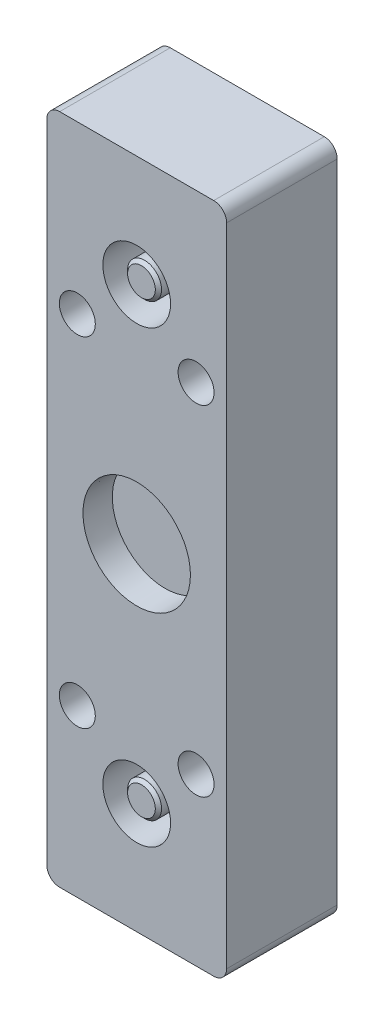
ISO-10303-21;
HEADER;
FILE_DESCRIPTION(('STEP AP214'),'2;1');
FILE_NAME('part.step','',(''),(''),'','','');
FILE_SCHEMA(('AUTOMOTIVE_DESIGN { 1 0 10303 214 1 1 1 1 }'));
ENDSEC;
DATA;
#1=APPLICATION_CONTEXT('core data for automotive mechanical design processes');
#2=APPLICATION_PROTOCOL_DEFINITION('international standard','automotive_design',2000,#1);
#3=PRODUCT_CONTEXT('',#1,'mechanical');
#4=PRODUCT('Part','Part','',(#3));
#5=PRODUCT_RELATED_PRODUCT_CATEGORY('part','',(#4));
#6=PRODUCT_DEFINITION_FORMATION('','',#4);
#7=PRODUCT_DEFINITION_CONTEXT('part definition',#1,'design');
#8=PRODUCT_DEFINITION('design','',#6,#7);
#9=PRODUCT_DEFINITION_SHAPE('','',#8);
#10=(LENGTH_UNIT() NAMED_UNIT(*) SI_UNIT(.MILLI.,.METRE.));
#11=(NAMED_UNIT(*) PLANE_ANGLE_UNIT() SI_UNIT($,.RADIAN.));
#12=(NAMED_UNIT(*) SI_UNIT($,.STERADIAN.) SOLID_ANGLE_UNIT());
#13=UNCERTAINTY_MEASURE_WITH_UNIT(LENGTH_MEASURE(1.E-05),#10,'distance_accuracy_value','');
#14=(GEOMETRIC_REPRESENTATION_CONTEXT(3) GLOBAL_UNCERTAINTY_ASSIGNED_CONTEXT((#13)) GLOBAL_UNIT_ASSIGNED_CONTEXT((#10,
#11,#12)) REPRESENTATION_CONTEXT('',''));
#15=CARTESIAN_POINT('',(0.,0.,0.));
#16=DIRECTION('',(0.,0.,1.));
#17=DIRECTION('',(1.,0.,0.));
#18=AXIS2_PLACEMENT_3D('',#15,#16,#17);
#19=CARTESIAN_POINT('',(0.,-78.95082,39.616588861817));
#20=DIRECTION('',(0.,0.,1.));
#21=DIRECTION('',(0.,-1.,0.));
#22=AXIS2_PLACEMENT_3D('',#19,#20,#21);
#23=PLANE('',#22);
#24=CARTESIAN_POINT('',(0.,-84.1375,39.6165888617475));
#25=DIRECTION('',(0.,0.,-1.));
#26=DIRECTION('',(-1.,0.,0.));
#27=AXIS2_PLACEMENT_3D('',#24,#25,#26);
#28=CIRCLE('',#27,5.18668000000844);
#29=CARTESIAN_POINT('',(-5.18668000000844,-84.1375,39.6165888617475));
#30=VERTEX_POINT('',#29);
#31=EDGE_CURVE('E20',#30,#30,#28,.T.);
#32=ORIENTED_EDGE('',*,*,#31,.F.);
#33=EDGE_LOOP('',(#32));
#34=FACE_BOUND('',#33,.T.);
#35=ADVANCED_FACE('F17',(#34),#23,.T.);
#36=CARTESIAN_POINT('',(0.,89.32418,39.616588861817));
#37=DIRECTION('',(0.,0.,1.));
#38=DIRECTION('',(0.,-1.,0.));
#39=AXIS2_PLACEMENT_3D('',#36,#37,#38);
#40=PLANE('',#39);
#41=CARTESIAN_POINT('',(0.,84.1375,39.6165888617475));
#42=DIRECTION('',(0.,0.,-1.));
#43=DIRECTION('',(-1.,0.,0.));
#44=AXIS2_PLACEMENT_3D('',#41,#42,#43);
#45=CIRCLE('',#44,5.18668000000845);
#46=CARTESIAN_POINT('',(-5.18668000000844,84.1375,39.6165888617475));
#47=VERTEX_POINT('',#46);
#48=EDGE_CURVE('E371',#47,#47,#45,.T.);
#49=ORIENTED_EDGE('',*,*,#48,.F.);
#50=EDGE_LOOP('',(#49));
#51=FACE_BOUND('',#50,.T.);
#52=ADVANCED_FACE('F155',(#51),#40,.T.);
#53=CARTESIAN_POINT('',(0.,-84.1375,5.88538886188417));
#54=DIRECTION('',(0.,0.,-1.));
#55=DIRECTION('',(0.,1.,0.));
#56=AXIS2_PLACEMENT_3D('',#53,#54,#55);
#57=CONICAL_SURFACE('',#56,3.96875000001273,1.04719755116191);
#58=CARTESIAN_POINT('',(8.5265128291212E-11,-84.1375,8.17674774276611));
#59=VERTEX_POINT('',#58);
#60=VERTEX_LOOP('',#59);
#61=FACE_BOUND('',#60,.T.);
#62=CARTESIAN_POINT('',(0.,-84.1375,5.88538886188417));
#63=DIRECTION('',(0.,0.,-1.));
#64=DIRECTION('',(0.,1.,0.));
#65=AXIS2_PLACEMENT_3D('',#62,#63,#64);
#66=CIRCLE('',#65,3.96875000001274);
#67=CARTESIAN_POINT('',(1.98437500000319,-80.700461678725,5.88538886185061));
#68=VERTEX_POINT('',#67);
#69=CARTESIAN_POINT('',(3.96875000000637,-84.1375,5.88538886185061));
#70=VERTEX_POINT('',#69);
#71=EDGE_CURVE('E158',#68,#70,#66,.T.);
#72=ORIENTED_EDGE('',*,*,#71,.T.);
#73=CARTESIAN_POINT('',(0.,-84.1375,5.88538886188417));
#74=DIRECTION('',(0.,0.,-1.));
#75=DIRECTION('',(0.,1.,0.));
#76=AXIS2_PLACEMENT_3D('',#73,#74,#75);
#77=CIRCLE('',#76,3.96875000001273);
#78=CARTESIAN_POINT('',(1.98437500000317,-87.574538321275,5.88538886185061));
#79=VERTEX_POINT('',#78);
#80=EDGE_CURVE('E130',#70,#79,#77,.T.);
#81=ORIENTED_EDGE('',*,*,#80,.T.);
#82=CARTESIAN_POINT('',(0.,-84.1375,5.88538886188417));
#83=DIRECTION('',(0.,0.,-1.));
#84=DIRECTION('',(0.,1.,0.));
#85=AXIS2_PLACEMENT_3D('',#82,#83,#84);
#86=CIRCLE('',#85,3.96875000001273);
#87=CARTESIAN_POINT('',(-1.98437500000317,-87.574538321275,5.88538886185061));
#88=VERTEX_POINT('',#87);
#89=EDGE_CURVE('E175',#79,#88,#86,.T.);
#90=ORIENTED_EDGE('',*,*,#89,.T.);
#91=CARTESIAN_POINT('',(0.,-84.1375,5.88538886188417));
#92=DIRECTION('',(0.,0.,-1.));
#93=DIRECTION('',(0.,1.,0.));
#94=AXIS2_PLACEMENT_3D('',#91,#92,#93);
#95=CIRCLE('',#94,3.96875000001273);
#96=CARTESIAN_POINT('',(-3.96874999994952,-84.1375,5.88538886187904));
#97=VERTEX_POINT('',#96);
#98=EDGE_CURVE('E366',#88,#97,#95,.T.);
#99=ORIENTED_EDGE('',*,*,#98,.T.);
#100=CARTESIAN_POINT('',(0.,-84.1375,5.88538886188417));
#101=DIRECTION('',(0.,0.,-1.));
#102=DIRECTION('',(0.,1.,0.));
#103=AXIS2_PLACEMENT_3D('',#100,#101,#102);
#104=CIRCLE('',#103,3.96875000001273);
#105=CARTESIAN_POINT('',(-1.98437500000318,-80.700461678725,5.88538886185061));
#106=VERTEX_POINT('',#105);
#107=EDGE_CURVE('E368',#97,#106,#104,.T.);
#108=ORIENTED_EDGE('',*,*,#107,.T.);
#109=CARTESIAN_POINT('',(0.,-84.1375,5.88538886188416));
#110=DIRECTION('',(0.,0.,-1.));
#111=DIRECTION('',(0.,1.,0.));
#112=AXIS2_PLACEMENT_3D('',#109,#110,#111);
#113=CIRCLE('',#112,3.96875000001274);
#114=EDGE_CURVE('E160',#106,#68,#113,.T.);
#115=ORIENTED_EDGE('',*,*,#114,.T.);
#116=EDGE_LOOP('',(#72,#81,#90,#99,#108,#115));
#117=FACE_BOUND('',#116,.T.);
#118=ADVANCED_FACE('F152',(#61,#117),#57,.F.);
#119=CARTESIAN_POINT('',(0.,84.1375,5.88538886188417));
#120=DIRECTION('',(0.,0.,-1.));
#121=DIRECTION('',(0.,1.,0.));
#122=AXIS2_PLACEMENT_3D('',#119,#120,#121);
#123=CONICAL_SURFACE('',#122,3.96875000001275,1.04719755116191);
#124=CARTESIAN_POINT('',(8.5265128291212E-11,84.1375,8.17674774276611));
#125=VERTEX_POINT('',#124);
#126=VERTEX_LOOP('',#125);
#127=FACE_BOUND('',#126,.T.);
#128=CARTESIAN_POINT('',(0.,84.1375,5.88538886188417));
#129=DIRECTION('',(0.,0.,-1.));
#130=DIRECTION('',(0.,1.,0.));
#131=AXIS2_PLACEMENT_3D('',#128,#129,#130);
#132=CIRCLE('',#131,3.96875000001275);
#133=CARTESIAN_POINT('',(1.98437500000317,87.574538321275,5.88538886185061));
#134=VERTEX_POINT('',#133);
#135=CARTESIAN_POINT('',(3.96875000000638,84.1375,5.88538886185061));
#136=VERTEX_POINT('',#135);
#137=EDGE_CURVE('E360',#134,#136,#132,.T.);
#138=ORIENTED_EDGE('',*,*,#137,.T.);
#139=CARTESIAN_POINT('',(0.,84.1375,5.88538886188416));
#140=DIRECTION('',(0.,0.,-1.));
#141=DIRECTION('',(0.,1.,0.));
#142=AXIS2_PLACEMENT_3D('',#139,#140,#141);
#143=CIRCLE('',#142,3.96875000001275);
#144=CARTESIAN_POINT('',(1.98437500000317,80.700461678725,5.88538886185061));
#145=VERTEX_POINT('',#144);
#146=EDGE_CURVE('E362',#136,#145,#143,.T.);
#147=ORIENTED_EDGE('',*,*,#146,.T.);
#148=CARTESIAN_POINT('',(0.,84.1375,5.88538886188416));
#149=DIRECTION('',(0.,0.,-1.));
#150=DIRECTION('',(0.,1.,0.));
#151=AXIS2_PLACEMENT_3D('',#148,#149,#150);
#152=CIRCLE('',#151,3.96875000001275);
#153=CARTESIAN_POINT('',(-1.98437500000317,80.700461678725,5.88538886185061));
#154=VERTEX_POINT('',#153);
#155=EDGE_CURVE('E364',#145,#154,#152,.T.);
#156=ORIENTED_EDGE('',*,*,#155,.T.);
#157=CARTESIAN_POINT('',(0.,84.1375,5.88538886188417));
#158=DIRECTION('',(0.,0.,-1.));
#159=DIRECTION('',(0.,1.,0.));
#160=AXIS2_PLACEMENT_3D('',#157,#158,#159);
#161=CIRCLE('',#160,3.96875000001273);
#162=CARTESIAN_POINT('',(-3.96875000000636,84.1375,5.88538886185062));
#163=VERTEX_POINT('',#162);
#164=EDGE_CURVE('E235',#154,#163,#161,.T.);
#165=ORIENTED_EDGE('',*,*,#164,.T.);
#166=CARTESIAN_POINT('',(0.,84.1375,5.88538886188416));
#167=DIRECTION('',(0.,0.,-1.));
#168=DIRECTION('',(0.,1.,0.));
#169=AXIS2_PLACEMENT_3D('',#166,#167,#168);
#170=CIRCLE('',#169,3.96875000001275);
#171=CARTESIAN_POINT('',(-1.98437500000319,87.574538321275,5.88538886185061));
#172=VERTEX_POINT('',#171);
#173=EDGE_CURVE('E356',#163,#172,#170,.T.);
#174=ORIENTED_EDGE('',*,*,#173,.T.);
#175=CARTESIAN_POINT('',(0.,84.1375,5.88538886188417));
#176=DIRECTION('',(0.,0.,-1.));
#177=DIRECTION('',(0.,1.,0.));
#178=AXIS2_PLACEMENT_3D('',#175,#176,#177);
#179=CIRCLE('',#178,3.96875000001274);
#180=EDGE_CURVE('E358',#172,#134,#179,.T.);
#181=ORIENTED_EDGE('',*,*,#180,.T.);
#182=EDGE_LOOP('',(#138,#147,#156,#165,#174,#181));
#183=FACE_BOUND('',#182,.T.);
#184=ADVANCED_FACE('F154',(#127,#183),#123,.F.);
#185=CARTESIAN_POINT('',(0.,-84.1375,38.4532688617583));
#186=DIRECTION('',(0.,0.,-1.));
#187=DIRECTION('',(-1.,0.,0.));
#188=AXIS2_PLACEMENT_3D('',#185,#186,#187);
#189=CONICAL_SURFACE('',#188,6.34999999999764,0.785398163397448);
#190=CARTESIAN_POINT('',(0.,-84.1375,38.4532688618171));
#191=DIRECTION('',(0.,0.,-1.));
#192=DIRECTION('',(0.,1.,0.));
#193=AXIS2_PLACEMENT_3D('',#190,#191,#192);
#194=CIRCLE('',#193,6.35);
#195=CARTESIAN_POINT('',(0.,-77.7875,38.4532688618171));
#196=VERTEX_POINT('',#195);
#197=EDGE_CURVE('E232',#196,#196,#194,.T.);
#198=ORIENTED_EDGE('',*,*,#197,.F.);
#199=EDGE_LOOP('',(#198));
#200=FACE_BOUND('',#199,.T.);
#201=ORIENTED_EDGE('',*,*,#31,.T.);
#202=EDGE_LOOP('',(#201));
#203=FACE_BOUND('',#202,.T.);
#204=ADVANCED_FACE('F378',(#200,#203),#189,.T.);
#205=CARTESIAN_POINT('',(0.,84.1375,38.4532688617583));
#206=DIRECTION('',(0.,0.,-1.));
#207=DIRECTION('',(-1.,0.,0.));
#208=AXIS2_PLACEMENT_3D('',#205,#206,#207);
#209=CONICAL_SURFACE('',#208,6.34999999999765,0.785398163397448);
#210=CARTESIAN_POINT('',(0.,84.1375,38.4532688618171));
#211=DIRECTION('',(0.,0.,-1.));
#212=DIRECTION('',(0.,1.,0.));
#213=AXIS2_PLACEMENT_3D('',#210,#211,#212);
#214=CIRCLE('',#213,6.35);
#215=CARTESIAN_POINT('',(0.,90.4875,38.4532688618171));
#216=VERTEX_POINT('',#215);
#217=EDGE_CURVE('E229',#216,#216,#214,.T.);
#218=ORIENTED_EDGE('',*,*,#217,.F.);
#219=EDGE_LOOP('',(#218));
#220=FACE_BOUND('',#219,.T.);
#221=ORIENTED_EDGE('',*,*,#48,.T.);
#222=EDGE_LOOP('',(#221));
#223=FACE_BOUND('',#222,.T.);
#224=ADVANCED_FACE('F621',(#220,#223),#209,.T.);
#225=CARTESIAN_POINT('',(3.96875,-86.4288588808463,5.88538886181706));
#226=DIRECTION('',(0.,0.,1.));
#227=DIRECTION('',(0.,-1.,0.));
#228=AXIS2_PLACEMENT_3D('',#225,#226,#227);
#229=PLANE('',#228);
#230=DIRECTION('',(-0.866025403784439,0.5,0.));
#231=VECTOR('',#230,1.);
#232=CARTESIAN_POINT('',(-3.96875,-86.4288588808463,5.88538886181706));
#233=LINE('',#232,#231);
#234=CARTESIAN_POINT('',(0.,-88.7202177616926,5.88538886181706));
#235=VERTEX_POINT('',#234);
#236=EDGE_CURVE('E140',#88,#235,#233,.F.);
#237=ORIENTED_EDGE('',*,*,#236,.F.);
#238=ORIENTED_EDGE('',*,*,#89,.F.);
#239=DIRECTION('',(-0.866025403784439,-0.5,0.));
#240=VECTOR('',#239,1.);
#241=CARTESIAN_POINT('',(0.,-88.7202177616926,5.88538886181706));
#242=LINE('',#241,#240);
#243=EDGE_CURVE('E202',#235,#79,#242,.F.);
#244=ORIENTED_EDGE('',*,*,#243,.F.);
#245=EDGE_LOOP('',(#237,#238,#244));
#246=FACE_BOUND('',#245,.T.);
#247=ADVANCED_FACE('F618',(#246),#229,.F.);
#248=CARTESIAN_POINT('',(3.96875,-86.4288588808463,5.88538886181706));
#249=DIRECTION('',(0.,0.,1.));
#250=DIRECTION('',(0.,-1.,0.));
#251=AXIS2_PLACEMENT_3D('',#248,#249,#250);
#252=PLANE('',#251);
#253=DIRECTION('',(-0.866025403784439,-0.5,0.));
#254=VECTOR('',#253,1.);
#255=CARTESIAN_POINT('',(0.,-88.7202177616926,5.88538886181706));
#256=LINE('',#255,#254);
#257=CARTESIAN_POINT('',(3.96875,-86.4288588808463,5.88538886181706));
#258=VERTEX_POINT('',#257);
#259=EDGE_CURVE('E173',#79,#258,#256,.F.);
#260=ORIENTED_EDGE('',*,*,#259,.F.);
#261=ORIENTED_EDGE('',*,*,#80,.F.);
#262=DIRECTION('',(0.,-1.,0.));
#263=VECTOR('',#262,1.);
#264=CARTESIAN_POINT('',(3.96875,-86.4288588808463,5.88538886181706));
#265=LINE('',#264,#263);
#266=EDGE_CURVE('E171',#258,#70,#265,.F.);
#267=ORIENTED_EDGE('',*,*,#266,.F.);
#268=EDGE_LOOP('',(#260,#261,#267));
#269=FACE_BOUND('',#268,.T.);
#270=ADVANCED_FACE('F169',(#269),#252,.F.);
#271=CARTESIAN_POINT('',(3.96875,-86.4288588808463,5.88538886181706));
#272=DIRECTION('',(0.,0.,1.));
#273=DIRECTION('',(0.,-1.,0.));
#274=AXIS2_PLACEMENT_3D('',#271,#272,#273);
#275=PLANE('',#274);
#276=DIRECTION('',(0.,-1.,0.));
#277=VECTOR('',#276,1.);
#278=CARTESIAN_POINT('',(3.96875,-86.4288588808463,5.88538886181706));
#279=LINE('',#278,#277);
#280=CARTESIAN_POINT('',(3.96875,-81.8461411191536,5.88538886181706));
#281=VERTEX_POINT('',#280);
#282=EDGE_CURVE('E178',#70,#281,#279,.F.);
#283=ORIENTED_EDGE('',*,*,#282,.F.);
#284=ORIENTED_EDGE('',*,*,#71,.F.);
#285=DIRECTION('',(0.866025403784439,-0.5,0.));
#286=VECTOR('',#285,1.);
#287=CARTESIAN_POINT('',(3.96875,-81.8461411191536,5.88538886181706));
#288=LINE('',#287,#286);
#289=EDGE_CURVE('E181',#281,#68,#288,.F.);
#290=ORIENTED_EDGE('',*,*,#289,.F.);
#291=EDGE_LOOP('',(#283,#284,#290));
#292=FACE_BOUND('',#291,.T.);
#293=ADVANCED_FACE('F179',(#292),#275,.F.);
#294=CARTESIAN_POINT('',(3.96875,-86.4288588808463,5.88538886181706));
#295=DIRECTION('',(0.,0.,1.));
#296=DIRECTION('',(0.,-1.,0.));
#297=AXIS2_PLACEMENT_3D('',#294,#295,#296);
#298=PLANE('',#297);
#299=DIRECTION('',(0.866025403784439,-0.5,0.));
#300=VECTOR('',#299,1.);
#301=CARTESIAN_POINT('',(3.96875,-81.8461411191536,5.88538886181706));
#302=LINE('',#301,#300);
#303=CARTESIAN_POINT('',(0.,-79.5547822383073,5.88538886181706));
#304=VERTEX_POINT('',#303);
#305=EDGE_CURVE('E746',#68,#304,#302,.F.);
#306=ORIENTED_EDGE('',*,*,#305,.F.);
#307=ORIENTED_EDGE('',*,*,#114,.F.);
#308=DIRECTION('',(0.866025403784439,0.5,0.));
#309=VECTOR('',#308,1.);
#310=CARTESIAN_POINT('',(0.,-79.5547822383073,5.88538886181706));
#311=LINE('',#310,#309);
#312=EDGE_CURVE('E726',#304,#106,#311,.F.);
#313=ORIENTED_EDGE('',*,*,#312,.F.);
#314=EDGE_LOOP('',(#306,#307,#313));
#315=FACE_BOUND('',#314,.T.);
#316=ADVANCED_FACE('F609',(#315),#298,.F.);
#317=CARTESIAN_POINT('',(3.96875,-86.4288588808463,5.88538886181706));
#318=DIRECTION('',(0.,0.,1.));
#319=DIRECTION('',(0.,-1.,0.));
#320=AXIS2_PLACEMENT_3D('',#317,#318,#319);
#321=PLANE('',#320);
#322=DIRECTION('',(0.866025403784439,0.5,0.));
#323=VECTOR('',#322,1.);
#324=CARTESIAN_POINT('',(0.,-79.5547822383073,5.88538886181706));
#325=LINE('',#324,#323);
#326=CARTESIAN_POINT('',(-3.96875,-81.8461411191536,5.88538886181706));
#327=VERTEX_POINT('',#326);
#328=EDGE_CURVE('E721',#106,#327,#325,.F.);
#329=ORIENTED_EDGE('',*,*,#328,.F.);
#330=ORIENTED_EDGE('',*,*,#107,.F.);
#331=DIRECTION('',(0.,1.,0.));
#332=VECTOR('',#331,1.);
#333=CARTESIAN_POINT('',(-3.96875,-81.8461411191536,5.88538886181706));
#334=LINE('',#333,#332);
#335=EDGE_CURVE('E700',#327,#97,#334,.F.);
#336=ORIENTED_EDGE('',*,*,#335,.F.);
#337=EDGE_LOOP('',(#329,#330,#336));
#338=FACE_BOUND('',#337,.T.);
#339=ADVANCED_FACE('F605',(#338),#321,.F.);
#340=CARTESIAN_POINT('',(3.96875,-86.4288588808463,5.88538886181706));
#341=DIRECTION('',(0.,0.,1.));
#342=DIRECTION('',(0.,-1.,0.));
#343=AXIS2_PLACEMENT_3D('',#340,#341,#342);
#344=PLANE('',#343);
#345=DIRECTION('',(0.,1.,0.));
#346=VECTOR('',#345,1.);
#347=CARTESIAN_POINT('',(-3.96875,-81.8461411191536,5.88538886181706));
#348=LINE('',#347,#346);
#349=CARTESIAN_POINT('',(-3.96875,-86.4288588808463,5.88538886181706));
#350=VERTEX_POINT('',#349);
#351=EDGE_CURVE('E703',#97,#350,#348,.F.);
#352=ORIENTED_EDGE('',*,*,#351,.F.);
#353=ORIENTED_EDGE('',*,*,#98,.F.);
#354=DIRECTION('',(-0.866025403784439,0.5,0.));
#355=VECTOR('',#354,1.);
#356=CARTESIAN_POINT('',(-3.96875,-86.4288588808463,5.88538886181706));
#357=LINE('',#356,#355);
#358=EDGE_CURVE('E221',#350,#88,#357,.F.);
#359=ORIENTED_EDGE('',*,*,#358,.F.);
#360=EDGE_LOOP('',(#352,#353,#359));
#361=FACE_BOUND('',#360,.T.);
#362=ADVANCED_FACE('F601',(#361),#344,.F.);
#363=CARTESIAN_POINT('',(3.96875,81.8461411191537,5.88538886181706));
#364=DIRECTION('',(0.,0.,1.));
#365=DIRECTION('',(0.,-1.,0.));
#366=AXIS2_PLACEMENT_3D('',#363,#364,#365);
#367=PLANE('',#366);
#368=DIRECTION('',(-0.866025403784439,0.5,0.));
#369=VECTOR('',#368,1.);
#370=CARTESIAN_POINT('',(-3.96875,81.8461411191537,5.88538886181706));
#371=LINE('',#370,#369);
#372=CARTESIAN_POINT('',(0.,79.5547822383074,5.88538886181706));
#373=VERTEX_POINT('',#372);
#374=EDGE_CURVE('E687',#154,#373,#371,.F.);
#375=ORIENTED_EDGE('',*,*,#374,.F.);
#376=ORIENTED_EDGE('',*,*,#155,.F.);
#377=DIRECTION('',(-0.866025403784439,-0.5,0.));
#378=VECTOR('',#377,1.);
#379=CARTESIAN_POINT('',(0.,79.5547822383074,5.88538886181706));
#380=LINE('',#379,#378);
#381=EDGE_CURVE('E671',#373,#145,#380,.F.);
#382=ORIENTED_EDGE('',*,*,#381,.F.);
#383=EDGE_LOOP('',(#375,#376,#382));
#384=FACE_BOUND('',#383,.T.);
#385=ADVANCED_FACE('F597',(#384),#367,.F.);
#386=CARTESIAN_POINT('',(3.96875,81.8461411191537,5.88538886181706));
#387=DIRECTION('',(0.,0.,1.));
#388=DIRECTION('',(0.,-1.,0.));
#389=AXIS2_PLACEMENT_3D('',#386,#387,#388);
#390=PLANE('',#389);
#391=DIRECTION('',(-0.866025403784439,-0.5,0.));
#392=VECTOR('',#391,1.);
#393=CARTESIAN_POINT('',(0.,79.5547822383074,5.88538886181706));
#394=LINE('',#393,#392);
#395=CARTESIAN_POINT('',(3.96875,81.8461411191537,5.88538886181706));
#396=VERTEX_POINT('',#395);
#397=EDGE_CURVE('E647',#145,#396,#394,.F.);
#398=ORIENTED_EDGE('',*,*,#397,.F.);
#399=ORIENTED_EDGE('',*,*,#146,.F.);
#400=DIRECTION('',(0.,-1.,0.));
#401=VECTOR('',#400,1.);
#402=CARTESIAN_POINT('',(3.96875,81.8461411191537,5.88538886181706));
#403=LINE('',#402,#401);
#404=EDGE_CURVE('E644',#396,#136,#403,.F.);
#405=ORIENTED_EDGE('',*,*,#404,.F.);
#406=EDGE_LOOP('',(#398,#399,#405));
#407=FACE_BOUND('',#406,.T.);
#408=ADVANCED_FACE('F593',(#407),#390,.F.);
#409=CARTESIAN_POINT('',(3.96875,81.8461411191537,5.88538886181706));
#410=DIRECTION('',(0.,0.,1.));
#411=DIRECTION('',(0.,-1.,0.));
#412=AXIS2_PLACEMENT_3D('',#409,#410,#411);
#413=PLANE('',#412);
#414=DIRECTION('',(0.,-1.,0.));
#415=VECTOR('',#414,1.);
#416=CARTESIAN_POINT('',(3.96875,81.8461411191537,5.88538886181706));
#417=LINE('',#416,#415);
#418=CARTESIAN_POINT('',(3.96875,86.4288588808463,5.88538886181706));
#419=VERTEX_POINT('',#418);
#420=EDGE_CURVE('E650',#136,#419,#417,.F.);
#421=ORIENTED_EDGE('',*,*,#420,.F.);
#422=ORIENTED_EDGE('',*,*,#137,.F.);
#423=DIRECTION('',(0.866025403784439,-0.5,0.));
#424=VECTOR('',#423,1.);
#425=CARTESIAN_POINT('',(3.96875,86.4288588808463,5.88538886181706));
#426=LINE('',#425,#424);
#427=EDGE_CURVE('E652',#419,#134,#426,.F.);
#428=ORIENTED_EDGE('',*,*,#427,.F.);
#429=EDGE_LOOP('',(#421,#422,#428));
#430=FACE_BOUND('',#429,.T.);
#431=ADVANCED_FACE('F589',(#430),#413,.F.);
#432=CARTESIAN_POINT('',(3.96875,81.8461411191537,5.88538886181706));
#433=DIRECTION('',(0.,0.,1.));
#434=DIRECTION('',(0.,-1.,0.));
#435=AXIS2_PLACEMENT_3D('',#432,#433,#434);
#436=PLANE('',#435);
#437=DIRECTION('',(0.866025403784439,-0.5,0.));
#438=VECTOR('',#437,1.);
#439=CARTESIAN_POINT('',(3.96875,86.4288588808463,5.88538886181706));
#440=LINE('',#439,#438);
#441=CARTESIAN_POINT('',(0.,88.7202177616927,5.88538886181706));
#442=VERTEX_POINT('',#441);
#443=EDGE_CURVE('E845',#134,#442,#440,.F.);
#444=ORIENTED_EDGE('',*,*,#443,.F.);
#445=ORIENTED_EDGE('',*,*,#180,.F.);
#446=DIRECTION('',(0.866025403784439,0.5,0.));
#447=VECTOR('',#446,1.);
#448=CARTESIAN_POINT('',(0.,88.7202177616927,5.88538886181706));
#449=LINE('',#448,#447);
#450=EDGE_CURVE('E836',#442,#172,#449,.F.);
#451=ORIENTED_EDGE('',*,*,#450,.F.);
#452=EDGE_LOOP('',(#444,#445,#451));
#453=FACE_BOUND('',#452,.T.);
#454=ADVANCED_FACE('F585',(#453),#436,.F.);
#455=CARTESIAN_POINT('',(3.96875,81.8461411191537,5.88538886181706));
#456=DIRECTION('',(0.,0.,1.));
#457=DIRECTION('',(0.,-1.,0.));
#458=AXIS2_PLACEMENT_3D('',#455,#456,#457);
#459=PLANE('',#458);
#460=DIRECTION('',(0.866025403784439,0.5,0.));
#461=VECTOR('',#460,1.);
#462=CARTESIAN_POINT('',(0.,88.7202177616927,5.88538886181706));
#463=LINE('',#462,#461);
#464=CARTESIAN_POINT('',(-3.96875000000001,86.4288588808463,5.88538886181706));
#465=VERTEX_POINT('',#464);
#466=EDGE_CURVE('E839',#172,#465,#463,.F.);
#467=ORIENTED_EDGE('',*,*,#466,.F.);
#468=ORIENTED_EDGE('',*,*,#173,.F.);
#469=DIRECTION('',(0.,1.,0.));
#470=VECTOR('',#469,1.);
#471=CARTESIAN_POINT('',(-3.96875,86.4288588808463,5.88538886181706));
#472=LINE('',#471,#470);
#473=EDGE_CURVE('E867',#465,#163,#472,.F.);
#474=ORIENTED_EDGE('',*,*,#473,.F.);
#475=EDGE_LOOP('',(#467,#468,#474));
#476=FACE_BOUND('',#475,.T.);
#477=ADVANCED_FACE('F581',(#476),#459,.F.);
#478=CARTESIAN_POINT('',(3.96875,81.8461411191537,5.88538886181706));
#479=DIRECTION('',(0.,0.,1.));
#480=DIRECTION('',(0.,-1.,0.));
#481=AXIS2_PLACEMENT_3D('',#478,#479,#480);
#482=PLANE('',#481);
#483=DIRECTION('',(0.,1.,0.));
#484=VECTOR('',#483,1.);
#485=CARTESIAN_POINT('',(-3.96875,86.4288588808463,5.88538886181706));
#486=LINE('',#485,#484);
#487=CARTESIAN_POINT('',(-3.96875,81.8461411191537,5.88538886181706));
#488=VERTEX_POINT('',#487);
#489=EDGE_CURVE('E819',#163,#488,#486,.F.);
#490=ORIENTED_EDGE('',*,*,#489,.F.);
#491=ORIENTED_EDGE('',*,*,#164,.F.);
#492=DIRECTION('',(-0.866025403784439,0.5,0.));
#493=VECTOR('',#492,1.);
#494=CARTESIAN_POINT('',(-3.96875,81.8461411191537,5.88538886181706));
#495=LINE('',#494,#493);
#496=EDGE_CURVE('E692',#488,#154,#495,.F.);
#497=ORIENTED_EDGE('',*,*,#496,.F.);
#498=EDGE_LOOP('',(#490,#491,#497));
#499=FACE_BOUND('',#498,.T.);
#500=ADVANCED_FACE('F577',(#499),#482,.F.);
#501=CARTESIAN_POINT('',(0.,-84.1375,1.51658886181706));
#502=DIRECTION('',(0.,0.,-1.));
#503=DIRECTION('',(0.,1.,0.));
#504=AXIS2_PLACEMENT_3D('',#501,#502,#503);
#505=CYLINDRICAL_SURFACE('',#504,6.35);
#506=CARTESIAN_POINT('',(0.,-84.1375,16.0020000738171));
#507=DIRECTION('',(0.,0.,-1.));
#508=DIRECTION('',(0.,1.,0.));
#509=AXIS2_PLACEMENT_3D('',#506,#507,#508);
#510=CIRCLE('',#509,6.35);
#511=CARTESIAN_POINT('',(0.,-77.7875,16.0020000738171));
#512=VERTEX_POINT('',#511);
#513=EDGE_CURVE('E351',#512,#512,#510,.T.);
#514=ORIENTED_EDGE('',*,*,#513,.F.);
#515=EDGE_LOOP('',(#514));
#516=FACE_BOUND('',#515,.T.);
#517=ORIENTED_EDGE('',*,*,#197,.T.);
#518=EDGE_LOOP('',(#517));
#519=FACE_BOUND('',#518,.T.);
#520=ADVANCED_FACE('F573',(#516,#519),#505,.T.);
#521=CARTESIAN_POINT('',(0.,84.1375,1.51658886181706));
#522=DIRECTION('',(0.,0.,-1.));
#523=DIRECTION('',(0.,1.,0.));
#524=AXIS2_PLACEMENT_3D('',#521,#522,#523);
#525=CYLINDRICAL_SURFACE('',#524,6.35);
#526=CARTESIAN_POINT('',(0.,84.1375,16.0020000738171));
#527=DIRECTION('',(0.,0.,-1.));
#528=DIRECTION('',(0.,1.,0.));
#529=AXIS2_PLACEMENT_3D('',#526,#527,#528);
#530=CIRCLE('',#529,6.35);
#531=CARTESIAN_POINT('',(0.,90.4875,16.0020000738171));
#532=VERTEX_POINT('',#531);
#533=EDGE_CURVE('E226',#532,#532,#530,.T.);
#534=ORIENTED_EDGE('',*,*,#533,.F.);
#535=EDGE_LOOP('',(#534));
#536=FACE_BOUND('',#535,.T.);
#537=ORIENTED_EDGE('',*,*,#217,.T.);
#538=EDGE_LOOP('',(#537));
#539=FACE_BOUND('',#538,.T.);
#540=ADVANCED_FACE('F570',(#536,#539),#525,.T.);
#541=CARTESIAN_POINT('',(-3.96875,-86.4288588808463,5.88538886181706));
#542=DIRECTION('',(0.5,0.866025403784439,0.));
#543=DIRECTION('',(-0.866025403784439,0.5,0.));
#544=AXIS2_PLACEMENT_3D('',#541,#542,#543);
#545=PLANE('',#544);
#546=ORIENTED_EDGE('',*,*,#236,.T.);
#547=DIRECTION('',(0.,0.,1.));
#548=VECTOR('',#547,1.);
#549=CARTESIAN_POINT('',(0.,-88.7202177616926,5.88538886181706));
#550=LINE('',#549,#548);
#551=CARTESIAN_POINT('',(0.,-88.7202177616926,1.51658886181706));
#552=VERTEX_POINT('',#551);
#553=EDGE_CURVE('E213',#552,#235,#550,.T.);
#554=ORIENTED_EDGE('',*,*,#553,.F.);
#555=DIRECTION('',(0.866025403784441,-0.499999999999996,0.));
#556=VECTOR('',#555,1.);
#557=CARTESIAN_POINT('',(-3.96875,-86.4288588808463,1.51658886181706));
#558=LINE('',#557,#556);
#559=CARTESIAN_POINT('',(-3.96875,-86.4288588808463,1.51658886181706));
#560=VERTEX_POINT('',#559);
#561=EDGE_CURVE('E209',#560,#552,#558,.T.);
#562=ORIENTED_EDGE('',*,*,#561,.F.);
#563=DIRECTION('',(0.,0.,1.));
#564=VECTOR('',#563,1.);
#565=CARTESIAN_POINT('',(-3.96875,-86.4288588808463,5.88538886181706));
#566=LINE('',#565,#564);
#567=EDGE_CURVE('E709',#350,#560,#566,.F.);
#568=ORIENTED_EDGE('',*,*,#567,.F.);
#569=ORIENTED_EDGE('',*,*,#358,.T.);
#570=EDGE_LOOP('',(#546,#554,#562,#568,#569));
#571=FACE_BOUND('',#570,.T.);
#572=ADVANCED_FACE('F566',(#571),#545,.T.);
#573=CARTESIAN_POINT('',(0.,-88.7202177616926,5.88538886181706));
#574=DIRECTION('',(-0.5,0.866025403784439,0.));
#575=DIRECTION('',(-0.866025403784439,-0.5,0.));
#576=AXIS2_PLACEMENT_3D('',#573,#574,#575);
#577=PLANE('',#576);
#578=ORIENTED_EDGE('',*,*,#259,.T.);
#579=DIRECTION('',(0.,0.,1.));
#580=VECTOR('',#579,1.);
#581=CARTESIAN_POINT('',(3.96875,-86.4288588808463,5.88538886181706));
#582=LINE('',#581,#580);
#583=CARTESIAN_POINT('',(3.96875,-86.4288588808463,1.51658886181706));
#584=VERTEX_POINT('',#583);
#585=EDGE_CURVE('E190',#584,#258,#582,.T.);
#586=ORIENTED_EDGE('',*,*,#585,.F.);
#587=DIRECTION('',(0.866025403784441,0.499999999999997,0.));
#588=VECTOR('',#587,1.);
#589=CARTESIAN_POINT('',(0.,-88.7202177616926,1.51658886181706));
#590=LINE('',#589,#588);
#591=EDGE_CURVE('E205',#552,#584,#590,.T.);
#592=ORIENTED_EDGE('',*,*,#591,.F.);
#593=ORIENTED_EDGE('',*,*,#553,.T.);
#594=ORIENTED_EDGE('',*,*,#243,.T.);
#595=EDGE_LOOP('',(#578,#586,#592,#593,#594));
#596=FACE_BOUND('',#595,.T.);
#597=ADVANCED_FACE('F563',(#596),#577,.T.);
#598=CARTESIAN_POINT('',(3.96875,-86.4288588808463,5.88538886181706));
#599=DIRECTION('',(-1.,0.,0.));
#600=DIRECTION('',(0.,-1.,0.));
#601=AXIS2_PLACEMENT_3D('',#598,#599,#600);
#602=PLANE('',#601);
#603=ORIENTED_EDGE('',*,*,#282,.T.);
#604=DIRECTION('',(0.,0.,1.));
#605=VECTOR('',#604,1.);
#606=CARTESIAN_POINT('',(3.96875,-81.8461411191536,5.88538886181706));
#607=LINE('',#606,#605);
#608=CARTESIAN_POINT('',(3.96875,-81.8461411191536,1.51658886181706));
#609=VERTEX_POINT('',#608);
#610=EDGE_CURVE('E185',#609,#281,#607,.T.);
#611=ORIENTED_EDGE('',*,*,#610,.F.);
#612=DIRECTION('',(0.,1.,0.));
#613=VECTOR('',#612,1.);
#614=CARTESIAN_POINT('',(3.96875,-84.1375,1.51658886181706));
#615=LINE('',#614,#613);
#616=EDGE_CURVE('E208',#584,#609,#615,.T.);
#617=ORIENTED_EDGE('',*,*,#616,.F.);
#618=ORIENTED_EDGE('',*,*,#585,.T.);
#619=ORIENTED_EDGE('',*,*,#266,.T.);
#620=EDGE_LOOP('',(#603,#611,#617,#618,#619));
#621=FACE_BOUND('',#620,.T.);
#622=ADVANCED_FACE('F187',(#621),#602,.T.);
#623=CARTESIAN_POINT('',(3.96875,-81.8461411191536,5.88538886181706));
#624=DIRECTION('',(-0.5,-0.866025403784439,0.));
#625=DIRECTION('',(0.866025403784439,-0.5,0.));
#626=AXIS2_PLACEMENT_3D('',#623,#624,#625);
#627=PLANE('',#626);
#628=ORIENTED_EDGE('',*,*,#305,.T.);
#629=DIRECTION('',(0.,0.,1.));
#630=VECTOR('',#629,1.);
#631=CARTESIAN_POINT('',(0.,-79.5547822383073,5.88538886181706));
#632=LINE('',#631,#630);
#633=CARTESIAN_POINT('',(0.,-79.5547822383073,1.51658886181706));
#634=VERTEX_POINT('',#633);
#635=EDGE_CURVE('E741',#634,#304,#632,.T.);
#636=ORIENTED_EDGE('',*,*,#635,.F.);
#637=DIRECTION('',(-0.866025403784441,0.499999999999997,0.));
#638=VECTOR('',#637,1.);
#639=CARTESIAN_POINT('',(3.96875,-81.8461411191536,1.51658886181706));
#640=LINE('',#639,#638);
#641=EDGE_CURVE('E736',#609,#634,#640,.T.);
#642=ORIENTED_EDGE('',*,*,#641,.F.);
#643=ORIENTED_EDGE('',*,*,#610,.T.);
#644=ORIENTED_EDGE('',*,*,#289,.T.);
#645=EDGE_LOOP('',(#628,#636,#642,#643,#644));
#646=FACE_BOUND('',#645,.T.);
#647=ADVANCED_FACE('F556',(#646),#627,.T.);
#648=CARTESIAN_POINT('',(0.,-79.5547822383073,5.88538886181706));
#649=DIRECTION('',(0.5,-0.866025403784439,0.));
#650=DIRECTION('',(0.866025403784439,0.5,0.));
#651=AXIS2_PLACEMENT_3D('',#648,#649,#650);
#652=PLANE('',#651);
#653=ORIENTED_EDGE('',*,*,#328,.T.);
#654=DIRECTION('',(0.,0.,1.));
#655=VECTOR('',#654,1.);
#656=CARTESIAN_POINT('',(-3.96875,-81.8461411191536,5.88538886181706));
#657=LINE('',#656,#655);
#658=CARTESIAN_POINT('',(-3.96875,-81.8461411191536,1.51658886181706));
#659=VERTEX_POINT('',#658);
#660=EDGE_CURVE('E704',#659,#327,#657,.T.);
#661=ORIENTED_EDGE('',*,*,#660,.F.);
#662=DIRECTION('',(-0.866025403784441,-0.499999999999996,0.));
#663=VECTOR('',#662,1.);
#664=CARTESIAN_POINT('',(0.,-79.5547822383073,1.51658886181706));
#665=LINE('',#664,#663);
#666=EDGE_CURVE('E731',#634,#659,#665,.T.);
#667=ORIENTED_EDGE('',*,*,#666,.F.);
#668=ORIENTED_EDGE('',*,*,#635,.T.);
#669=ORIENTED_EDGE('',*,*,#312,.T.);
#670=EDGE_LOOP('',(#653,#661,#667,#668,#669));
#671=FACE_BOUND('',#670,.T.);
#672=ADVANCED_FACE('F552',(#671),#652,.T.);
#673=CARTESIAN_POINT('',(-3.96875,-81.8461411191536,5.88538886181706));
#674=DIRECTION('',(1.,0.,0.));
#675=DIRECTION('',(0.,1.,0.));
#676=AXIS2_PLACEMENT_3D('',#673,#674,#675);
#677=PLANE('',#676);
#678=ORIENTED_EDGE('',*,*,#351,.T.);
#679=ORIENTED_EDGE('',*,*,#567,.T.);
#680=DIRECTION('',(0.,1.,0.));
#681=VECTOR('',#680,1.);
#682=CARTESIAN_POINT('',(-3.96875,-84.1375,1.51658886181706));
#683=LINE('',#682,#681);
#684=EDGE_CURVE('E697',#659,#560,#683,.F.);
#685=ORIENTED_EDGE('',*,*,#684,.F.);
#686=ORIENTED_EDGE('',*,*,#660,.T.);
#687=ORIENTED_EDGE('',*,*,#335,.T.);
#688=EDGE_LOOP('',(#678,#679,#685,#686,#687));
#689=FACE_BOUND('',#688,.T.);
#690=ADVANCED_FACE('F548',(#689),#677,.T.);
#691=CARTESIAN_POINT('',(-3.96875,81.8461411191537,5.88538886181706));
#692=DIRECTION('',(0.5,0.866025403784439,0.));
#693=DIRECTION('',(-0.866025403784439,0.5,0.));
#694=AXIS2_PLACEMENT_3D('',#691,#692,#693);
#695=PLANE('',#694);
#696=ORIENTED_EDGE('',*,*,#374,.T.);
#697=DIRECTION('',(0.,0.,1.));
#698=VECTOR('',#697,1.);
#699=CARTESIAN_POINT('',(0.,79.5547822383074,5.88538886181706));
#700=LINE('',#699,#698);
#701=CARTESIAN_POINT('',(0.,79.5547822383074,1.51658886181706));
#702=VERTEX_POINT('',#701);
#703=EDGE_CURVE('E682',#702,#373,#700,.T.);
#704=ORIENTED_EDGE('',*,*,#703,.F.);
#705=DIRECTION('',(0.86602540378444,-0.499999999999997,0.));
#706=VECTOR('',#705,1.);
#707=CARTESIAN_POINT('',(-3.96875,81.8461411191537,1.51658886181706));
#708=LINE('',#707,#706);
#709=CARTESIAN_POINT('',(-3.96875,81.8461411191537,1.51658886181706));
#710=VERTEX_POINT('',#709);
#711=EDGE_CURVE('E678',#710,#702,#708,.T.);
#712=ORIENTED_EDGE('',*,*,#711,.F.);
#713=DIRECTION('',(0.,0.,1.));
#714=VECTOR('',#713,1.);
#715=CARTESIAN_POINT('',(-3.96875,81.8461411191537,5.88538886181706));
#716=LINE('',#715,#714);
#717=EDGE_CURVE('E354',#488,#710,#716,.F.);
#718=ORIENTED_EDGE('',*,*,#717,.F.);
#719=ORIENTED_EDGE('',*,*,#496,.T.);
#720=EDGE_LOOP('',(#696,#704,#712,#718,#719));
#721=FACE_BOUND('',#720,.T.);
#722=ADVANCED_FACE('F544',(#721),#695,.T.);
#723=CARTESIAN_POINT('',(0.,79.5547822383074,5.88538886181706));
#724=DIRECTION('',(-0.5,0.866025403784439,0.));
#725=DIRECTION('',(-0.866025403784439,-0.5,0.));
#726=AXIS2_PLACEMENT_3D('',#723,#724,#725);
#727=PLANE('',#726);
#728=ORIENTED_EDGE('',*,*,#397,.T.);
#729=DIRECTION('',(0.,0.,1.));
#730=VECTOR('',#729,1.);
#731=CARTESIAN_POINT('',(3.96875,81.8461411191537,5.88538886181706));
#732=LINE('',#731,#730);
#733=CARTESIAN_POINT('',(3.96875,81.8461411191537,1.51658886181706));
#734=VERTEX_POINT('',#733);
#735=EDGE_CURVE('E659',#734,#396,#732,.T.);
#736=ORIENTED_EDGE('',*,*,#735,.F.);
#737=DIRECTION('',(0.866025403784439,0.5,0.));
#738=VECTOR('',#737,1.);
#739=CARTESIAN_POINT('',(0.,79.5547822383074,1.51658886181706));
#740=LINE('',#739,#738);
#741=EDGE_CURVE('E674',#702,#734,#740,.T.);
#742=ORIENTED_EDGE('',*,*,#741,.F.);
#743=ORIENTED_EDGE('',*,*,#703,.T.);
#744=ORIENTED_EDGE('',*,*,#381,.T.);
#745=EDGE_LOOP('',(#728,#736,#742,#743,#744));
#746=FACE_BOUND('',#745,.T.);
#747=ADVANCED_FACE('F540',(#746),#727,.T.);
#748=CARTESIAN_POINT('',(3.96875,81.8461411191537,5.88538886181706));
#749=DIRECTION('',(-1.,0.,0.));
#750=DIRECTION('',(0.,-1.,0.));
#751=AXIS2_PLACEMENT_3D('',#748,#749,#750);
#752=PLANE('',#751);
#753=ORIENTED_EDGE('',*,*,#420,.T.);
#754=DIRECTION('',(0.,0.,1.));
#755=VECTOR('',#754,1.);
#756=CARTESIAN_POINT('',(3.96875,86.4288588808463,5.88538886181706));
#757=LINE('',#756,#755);
#758=CARTESIAN_POINT('',(3.96875,86.4288588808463,1.51658886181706));
#759=VERTEX_POINT('',#758);
#760=EDGE_CURVE('E655',#759,#419,#757,.T.);
#761=ORIENTED_EDGE('',*,*,#760,.F.);
#762=DIRECTION('',(0.,1.,0.));
#763=VECTOR('',#762,1.);
#764=CARTESIAN_POINT('',(3.96875,84.1375,1.51658886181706));
#765=LINE('',#764,#763);
#766=EDGE_CURVE('E677',#734,#759,#765,.T.);
#767=ORIENTED_EDGE('',*,*,#766,.F.);
#768=ORIENTED_EDGE('',*,*,#735,.T.);
#769=ORIENTED_EDGE('',*,*,#404,.T.);
#770=EDGE_LOOP('',(#753,#761,#767,#768,#769));
#771=FACE_BOUND('',#770,.T.);
#772=ADVANCED_FACE('F536',(#771),#752,.T.);
#773=CARTESIAN_POINT('',(3.96875,86.4288588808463,5.88538886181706));
#774=DIRECTION('',(-0.5,-0.866025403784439,0.));
#775=DIRECTION('',(0.866025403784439,-0.5,0.));
#776=AXIS2_PLACEMENT_3D('',#773,#774,#775);
#777=PLANE('',#776);
#778=ORIENTED_EDGE('',*,*,#443,.T.);
#779=DIRECTION('',(0.,0.,1.));
#780=VECTOR('',#779,1.);
#781=CARTESIAN_POINT('',(0.,88.7202177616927,5.88538886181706));
#782=LINE('',#781,#780);
#783=CARTESIAN_POINT('',(0.,88.7202177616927,1.51658886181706));
#784=VERTEX_POINT('',#783);
#785=EDGE_CURVE('E840',#784,#442,#782,.T.);
#786=ORIENTED_EDGE('',*,*,#785,.F.);
#787=DIRECTION('',(-0.866025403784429,0.500000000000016,0.));
#788=VECTOR('',#787,1.);
#789=CARTESIAN_POINT('',(3.96875,86.4288588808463,1.51658886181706));
#790=LINE('',#789,#788);
#791=EDGE_CURVE('E826',#759,#784,#790,.T.);
#792=ORIENTED_EDGE('',*,*,#791,.F.);
#793=ORIENTED_EDGE('',*,*,#760,.T.);
#794=ORIENTED_EDGE('',*,*,#427,.T.);
#795=EDGE_LOOP('',(#778,#786,#792,#793,#794));
#796=FACE_BOUND('',#795,.T.);
#797=ADVANCED_FACE('F532',(#796),#777,.T.);
#798=CARTESIAN_POINT('',(0.,88.7202177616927,5.88538886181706));
#799=DIRECTION('',(0.5,-0.866025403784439,0.));
#800=DIRECTION('',(0.866025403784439,0.5,0.));
#801=AXIS2_PLACEMENT_3D('',#798,#799,#800);
#802=PLANE('',#801);
#803=ORIENTED_EDGE('',*,*,#466,.T.);
#804=DIRECTION('',(0.,0.,1.));
#805=VECTOR('',#804,1.);
#806=CARTESIAN_POINT('',(-3.96875,86.4288588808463,5.88538886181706));
#807=LINE('',#806,#805);
#808=CARTESIAN_POINT('',(-3.96875,86.4288588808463,1.51658886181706));
#809=VERTEX_POINT('',#808);
#810=EDGE_CURVE('E864',#809,#465,#807,.T.);
#811=ORIENTED_EDGE('',*,*,#810,.F.);
#812=DIRECTION('',(-0.866025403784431,-0.500000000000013,0.));
#813=VECTOR('',#812,1.);
#814=CARTESIAN_POINT('',(0.,88.7202177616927,1.51658886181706));
#815=LINE('',#814,#813);
#816=EDGE_CURVE('E824',#784,#809,#815,.T.);
#817=ORIENTED_EDGE('',*,*,#816,.F.);
#818=ORIENTED_EDGE('',*,*,#785,.T.);
#819=ORIENTED_EDGE('',*,*,#450,.T.);
#820=EDGE_LOOP('',(#803,#811,#817,#818,#819));
#821=FACE_BOUND('',#820,.T.);
#822=ADVANCED_FACE('F528',(#821),#802,.T.);
#823=CARTESIAN_POINT('',(-3.96875,86.4288588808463,5.88538886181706));
#824=DIRECTION('',(1.,0.,0.));
#825=DIRECTION('',(0.,1.,0.));
#826=AXIS2_PLACEMENT_3D('',#823,#824,#825);
#827=PLANE('',#826);
#828=ORIENTED_EDGE('',*,*,#489,.T.);
#829=ORIENTED_EDGE('',*,*,#717,.T.);
#830=DIRECTION('',(0.,1.,0.));
#831=VECTOR('',#830,1.);
#832=CARTESIAN_POINT('',(-3.96875,84.1375,1.51658886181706));
#833=LINE('',#832,#831);
#834=EDGE_CURVE('E348',#809,#710,#833,.F.);
#835=ORIENTED_EDGE('',*,*,#834,.F.);
#836=ORIENTED_EDGE('',*,*,#810,.T.);
#837=ORIENTED_EDGE('',*,*,#473,.T.);
#838=EDGE_LOOP('',(#828,#829,#835,#836,#837));
#839=FACE_BOUND('',#838,.T.);
#840=ADVANCED_FACE('F524',(#839),#827,.T.);
#841=CARTESIAN_POINT('',(-28.829,120.904,30.734));
#842=DIRECTION('',(0.,0.,-1.));
#843=DIRECTION('',(-1.,0.,0.));
#844=AXIS2_PLACEMENT_3D('',#841,#842,#843);
#845=PLANE('',#844);
#846=CARTESIAN_POINT('',(0.,0.,30.734));
#847=DIRECTION('',(0.,0.,1.));
#848=DIRECTION('',(1.,0.,0.));
#849=AXIS2_PLACEMENT_3D('',#846,#847,#848);
#850=CIRCLE('',#849,19.7895117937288);
#851=CARTESIAN_POINT('',(19.7895117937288,0.,30.734));
#852=VERTEX_POINT('',#851);
#853=EDGE_CURVE('E345',#852,#852,#850,.T.);
#854=ORIENTED_EDGE('',*,*,#853,.T.);
#855=EDGE_LOOP('',(#854));
#856=FACE_BOUND('',#855,.T.);
#857=ADVANCED_FACE('F520',(#856),#845,.F.);
#858=CARTESIAN_POINT('',(0.,-84.1375,16.002));
#859=DIRECTION('',(0.,0.,1.));
#860=DIRECTION('',(1.,0.,0.));
#861=AXIS2_PLACEMENT_3D('',#858,#859,#860);
#862=PLANE('',#861);
#863=ORIENTED_EDGE('',*,*,#513,.T.);
#864=EDGE_LOOP('',(#863));
#865=FACE_BOUND('',#864,.T.);
#866=CARTESIAN_POINT('',(0.,-84.1375,16.002));
#867=DIRECTION('',(0.,0.,1.));
#868=DIRECTION('',(1.,0.,0.));
#869=AXIS2_PLACEMENT_3D('',#866,#867,#868);
#870=CIRCLE('',#869,12.6746);
#871=CARTESIAN_POINT('',(12.6746,-84.1375,16.002));
#872=VERTEX_POINT('',#871);
#873=EDGE_CURVE('E342',#872,#872,#870,.T.);
#874=ORIENTED_EDGE('',*,*,#873,.T.);
#875=EDGE_LOOP('',(#874));
#876=FACE_BOUND('',#875,.T.);
#877=ADVANCED_FACE('F516',(#865,#876),#862,.T.);
#878=CARTESIAN_POINT('',(0.,84.1375,16.002));
#879=DIRECTION('',(0.,0.,1.));
#880=DIRECTION('',(1.,0.,0.));
#881=AXIS2_PLACEMENT_3D('',#878,#879,#880);
#882=PLANE('',#881);
#883=ORIENTED_EDGE('',*,*,#533,.T.);
#884=EDGE_LOOP('',(#883));
#885=FACE_BOUND('',#884,.T.);
#886=CARTESIAN_POINT('',(0.,84.1375,16.002));
#887=DIRECTION('',(0.,0.,1.));
#888=DIRECTION('',(1.,0.,0.));
#889=AXIS2_PLACEMENT_3D('',#886,#887,#888);
#890=CIRCLE('',#889,12.6746);
#891=CARTESIAN_POINT('',(12.6746,84.1375,16.002));
#892=VERTEX_POINT('',#891);
#893=EDGE_CURVE('E339',#892,#892,#890,.T.);
#894=ORIENTED_EDGE('',*,*,#893,.T.);
#895=EDGE_LOOP('',(#894));
#896=FACE_BOUND('',#895,.T.);
#897=ADVANCED_FACE('F512',(#885,#896),#882,.T.);
#898=CARTESIAN_POINT('',(0.,-84.1375,1.51658886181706));
#899=DIRECTION('',(0.,0.,-1.));
#900=DIRECTION('',(0.,1.,0.));
#901=AXIS2_PLACEMENT_3D('',#898,#899,#900);
#902=PLANE('',#901);
#903=ORIENTED_EDGE('',*,*,#666,.T.);
#904=ORIENTED_EDGE('',*,*,#684,.T.);
#905=ORIENTED_EDGE('',*,*,#561,.T.);
#906=ORIENTED_EDGE('',*,*,#591,.T.);
#907=ORIENTED_EDGE('',*,*,#616,.T.);
#908=ORIENTED_EDGE('',*,*,#641,.T.);
#909=EDGE_LOOP('',(#903,#904,#905,#906,#907,#908));
#910=FACE_BOUND('',#909,.T.);
#911=CARTESIAN_POINT('',(0.,-84.1375,1.51658886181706));
#912=DIRECTION('',(0.,0.,-1.));
#913=DIRECTION('',(0.,1.,0.));
#914=AXIS2_PLACEMENT_3D('',#911,#912,#913);
#915=CIRCLE('',#914,11.90625);
#916=CARTESIAN_POINT('',(0.,-72.23125,1.51658886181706));
#917=VERTEX_POINT('',#916);
#918=EDGE_CURVE('E336',#917,#917,#915,.F.);
#919=ORIENTED_EDGE('',*,*,#918,.F.);
#920=EDGE_LOOP('',(#919));
#921=FACE_BOUND('',#920,.T.);
#922=ADVANCED_FACE('F508',(#910,#921),#902,.T.);
#923=CARTESIAN_POINT('',(0.,84.1375,1.51658886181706));
#924=DIRECTION('',(0.,0.,-1.));
#925=DIRECTION('',(0.,1.,0.));
#926=AXIS2_PLACEMENT_3D('',#923,#924,#925);
#927=PLANE('',#926);
#928=ORIENTED_EDGE('',*,*,#816,.T.);
#929=ORIENTED_EDGE('',*,*,#834,.T.);
#930=ORIENTED_EDGE('',*,*,#711,.T.);
#931=ORIENTED_EDGE('',*,*,#741,.T.);
#932=ORIENTED_EDGE('',*,*,#766,.T.);
#933=ORIENTED_EDGE('',*,*,#791,.T.);
#934=EDGE_LOOP('',(#928,#929,#930,#931,#932,#933));
#935=FACE_BOUND('',#934,.T.);
#936=CARTESIAN_POINT('',(0.,84.1375,1.51658886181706));
#937=DIRECTION('',(0.,0.,-1.));
#938=DIRECTION('',(0.,1.,0.));
#939=AXIS2_PLACEMENT_3D('',#936,#937,#938);
#940=CIRCLE('',#939,11.90625);
#941=CARTESIAN_POINT('',(0.,96.04375,1.51658886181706));
#942=VERTEX_POINT('',#941);
#943=EDGE_CURVE('E333',#942,#942,#940,.F.);
#944=ORIENTED_EDGE('',*,*,#943,.F.);
#945=EDGE_LOOP('',(#944));
#946=FACE_BOUND('',#945,.T.);
#947=ADVANCED_FACE('F504',(#935,#946),#927,.T.);
#948=CARTESIAN_POINT('',(0.,0.,41.4020000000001));
#949=DIRECTION('',(0.,0.,1.));
#950=DIRECTION('',(1.,0.,0.));
#951=AXIS2_PLACEMENT_3D('',#948,#949,#950);
#952=CONICAL_SURFACE('',#951,20.108926,0.0299323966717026);
#953=ORIENTED_EDGE('',*,*,#853,.F.);
#954=EDGE_LOOP('',(#953));
#955=FACE_BOUND('',#954,.T.);
#956=CARTESIAN_POINT('',(0.,0.,41.4020000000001));
#957=DIRECTION('',(0.,0.,1.));
#958=DIRECTION('',(1.,0.,0.));
#959=AXIS2_PLACEMENT_3D('',#956,#957,#958);
#960=CIRCLE('',#959,20.108926);
#961=CARTESIAN_POINT('',(20.108926,0.,41.4020000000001));
#962=VERTEX_POINT('',#961);
#963=EDGE_CURVE('E318',#962,#962,#960,.T.);
#964=ORIENTED_EDGE('',*,*,#963,.T.);
#965=EDGE_LOOP('',(#964));
#966=FACE_BOUND('',#965,.T.);
#967=ADVANCED_FACE('F500',(#955,#966),#952,.F.);
#968=CARTESIAN_POINT('',(0.,-84.1375,16.002));
#969=DIRECTION('',(0.,0.,1.));
#970=DIRECTION('',(1.,0.,0.));
#971=AXIS2_PLACEMENT_3D('',#968,#969,#970);
#972=CYLINDRICAL_SURFACE('',#971,12.6746);
#973=ORIENTED_EDGE('',*,*,#873,.F.);
#974=EDGE_LOOP('',(#973));
#975=FACE_BOUND('',#974,.T.);
#976=CARTESIAN_POINT('',(0.,-84.1375,41.402));
#977=DIRECTION('',(0.,0.,1.));
#978=DIRECTION('',(1.,0.,0.));
#979=AXIS2_PLACEMENT_3D('',#976,#977,#978);
#980=CIRCLE('',#979,12.6746);
#981=CARTESIAN_POINT('',(12.6746,-84.1375,41.402));
#982=VERTEX_POINT('',#981);
#983=EDGE_CURVE('E315',#982,#982,#980,.T.);
#984=ORIENTED_EDGE('',*,*,#983,.T.);
#985=EDGE_LOOP('',(#984));
#986=FACE_BOUND('',#985,.T.);
#987=ADVANCED_FACE('F496',(#975,#986),#972,.F.);
#988=CARTESIAN_POINT('',(0.,84.1375,16.002));
#989=DIRECTION('',(0.,0.,1.));
#990=DIRECTION('',(1.,0.,0.));
#991=AXIS2_PLACEMENT_3D('',#988,#989,#990);
#992=CYLINDRICAL_SURFACE('',#991,12.6746);
#993=ORIENTED_EDGE('',*,*,#893,.F.);
#994=EDGE_LOOP('',(#993));
#995=FACE_BOUND('',#994,.T.);
#996=CARTESIAN_POINT('',(0.,84.1375,41.402));
#997=DIRECTION('',(0.,0.,1.));
#998=DIRECTION('',(1.,0.,0.));
#999=AXIS2_PLACEMENT_3D('',#996,#997,#998);
#1000=CIRCLE('',#999,12.6746);
#1001=CARTESIAN_POINT('',(12.6746,84.1375,41.402));
#1002=VERTEX_POINT('',#1001);
#1003=EDGE_CURVE('E312',#1002,#1002,#1000,.T.);
#1004=ORIENTED_EDGE('',*,*,#1003,.T.);
#1005=EDGE_LOOP('',(#1004));
#1006=FACE_BOUND('',#1005,.T.);
#1007=ADVANCED_FACE('F492',(#995,#1006),#992,.F.);
#1008=CARTESIAN_POINT('',(-22.225,-63.5,28.702));
#1009=DIRECTION('',(0.,0.,1.));
#1010=DIRECTION('',(1.,0.,0.));
#1011=AXIS2_PLACEMENT_3D('',#1008,#1009,#1010);
#1012=CYLINDRICAL_SURFACE('',#1011,6.731);
#1013=CARTESIAN_POINT('',(-22.225,-63.5,28.702));
#1014=DIRECTION('',(0.,0.,1.));
#1015=DIRECTION('',(1.,0.,0.));
#1016=AXIS2_PLACEMENT_3D('',#1013,#1014,#1015);
#1017=CIRCLE('',#1016,6.731);
#1018=CARTESIAN_POINT('',(-15.494,-63.5,28.702));
#1019=VERTEX_POINT('',#1018);
#1020=EDGE_CURVE('E330',#1019,#1019,#1017,.T.);
#1021=ORIENTED_EDGE('',*,*,#1020,.F.);
#1022=EDGE_LOOP('',(#1021));
#1023=FACE_BOUND('',#1022,.T.);
#1024=CARTESIAN_POINT('',(-22.225,-63.5,41.402));
#1025=DIRECTION('',(0.,0.,1.));
#1026=DIRECTION('',(1.,0.,0.));
#1027=AXIS2_PLACEMENT_3D('',#1024,#1025,#1026);
#1028=CIRCLE('',#1027,6.731);
#1029=CARTESIAN_POINT('',(-15.494,-63.5,41.402));
#1030=VERTEX_POINT('',#1029);
#1031=EDGE_CURVE('E309',#1030,#1030,#1028,.T.);
#1032=ORIENTED_EDGE('',*,*,#1031,.T.);
#1033=EDGE_LOOP('',(#1032));
#1034=FACE_BOUND('',#1033,.T.);
#1035=ADVANCED_FACE('F488',(#1023,#1034),#1012,.F.);
#1036=CARTESIAN_POINT('',(-22.225,63.5,28.702));
#1037=DIRECTION('',(0.,0.,1.));
#1038=DIRECTION('',(1.,0.,0.));
#1039=AXIS2_PLACEMENT_3D('',#1036,#1037,#1038);
#1040=CYLINDRICAL_SURFACE('',#1039,6.731);
#1041=CARTESIAN_POINT('',(-22.225,63.5,28.702));
#1042=DIRECTION('',(0.,0.,1.));
#1043=DIRECTION('',(1.,0.,0.));
#1044=AXIS2_PLACEMENT_3D('',#1041,#1042,#1043);
#1045=CIRCLE('',#1044,6.731);
#1046=CARTESIAN_POINT('',(-15.494,63.5,28.702));
#1047=VERTEX_POINT('',#1046);
#1048=EDGE_CURVE('E327',#1047,#1047,#1045,.T.);
#1049=ORIENTED_EDGE('',*,*,#1048,.F.);
#1050=EDGE_LOOP('',(#1049));
#1051=FACE_BOUND('',#1050,.T.);
#1052=CARTESIAN_POINT('',(-22.225,63.5,41.402));
#1053=DIRECTION('',(0.,0.,1.));
#1054=DIRECTION('',(1.,0.,0.));
#1055=AXIS2_PLACEMENT_3D('',#1052,#1053,#1054);
#1056=CIRCLE('',#1055,6.731);
#1057=CARTESIAN_POINT('',(-15.494,63.5,41.402));
#1058=VERTEX_POINT('',#1057);
#1059=EDGE_CURVE('E306',#1058,#1058,#1056,.T.);
#1060=ORIENTED_EDGE('',*,*,#1059,.T.);
#1061=EDGE_LOOP('',(#1060));
#1062=FACE_BOUND('',#1061,.T.);
#1063=ADVANCED_FACE('F484',(#1051,#1062),#1040,.F.);
#1064=CARTESIAN_POINT('',(22.225,-63.5,28.702));
#1065=DIRECTION('',(0.,0.,1.));
#1066=DIRECTION('',(1.,0.,0.));
#1067=AXIS2_PLACEMENT_3D('',#1064,#1065,#1066);
#1068=CYLINDRICAL_SURFACE('',#1067,6.731);
#1069=CARTESIAN_POINT('',(22.225,-63.5,28.702));
#1070=DIRECTION('',(0.,0.,1.));
#1071=DIRECTION('',(1.,0.,0.));
#1072=AXIS2_PLACEMENT_3D('',#1069,#1070,#1071);
#1073=CIRCLE('',#1072,6.731);
#1074=CARTESIAN_POINT('',(28.956,-63.5,28.702));
#1075=VERTEX_POINT('',#1074);
#1076=EDGE_CURVE('E324',#1075,#1075,#1073,.T.);
#1077=ORIENTED_EDGE('',*,*,#1076,.F.);
#1078=EDGE_LOOP('',(#1077));
#1079=FACE_BOUND('',#1078,.T.);
#1080=CARTESIAN_POINT('',(22.225,-63.5,41.402));
#1081=DIRECTION('',(0.,0.,1.));
#1082=DIRECTION('',(1.,0.,0.));
#1083=AXIS2_PLACEMENT_3D('',#1080,#1081,#1082);
#1084=CIRCLE('',#1083,6.731);
#1085=CARTESIAN_POINT('',(28.956,-63.5,41.402));
#1086=VERTEX_POINT('',#1085);
#1087=EDGE_CURVE('E303',#1086,#1086,#1084,.T.);
#1088=ORIENTED_EDGE('',*,*,#1087,.T.);
#1089=EDGE_LOOP('',(#1088));
#1090=FACE_BOUND('',#1089,.T.);
#1091=ADVANCED_FACE('F480',(#1079,#1090),#1068,.F.);
#1092=CARTESIAN_POINT('',(22.225,63.5,28.702));
#1093=DIRECTION('',(0.,0.,1.));
#1094=DIRECTION('',(1.,0.,0.));
#1095=AXIS2_PLACEMENT_3D('',#1092,#1093,#1094);
#1096=CYLINDRICAL_SURFACE('',#1095,6.731);
#1097=CARTESIAN_POINT('',(22.225,63.5,28.702));
#1098=DIRECTION('',(0.,0.,1.));
#1099=DIRECTION('',(1.,0.,0.));
#1100=AXIS2_PLACEMENT_3D('',#1097,#1098,#1099);
#1101=CIRCLE('',#1100,6.731);
#1102=CARTESIAN_POINT('',(28.956,63.5,28.702));
#1103=VERTEX_POINT('',#1102);
#1104=EDGE_CURVE('E321',#1103,#1103,#1101,.T.);
#1105=ORIENTED_EDGE('',*,*,#1104,.F.);
#1106=EDGE_LOOP('',(#1105));
#1107=FACE_BOUND('',#1106,.T.);
#1108=CARTESIAN_POINT('',(22.225,63.5,41.402));
#1109=DIRECTION('',(0.,0.,1.));
#1110=DIRECTION('',(1.,0.,0.));
#1111=AXIS2_PLACEMENT_3D('',#1108,#1109,#1110);
#1112=CIRCLE('',#1111,6.731);
#1113=CARTESIAN_POINT('',(28.956,63.5,41.402));
#1114=VERTEX_POINT('',#1113);
#1115=EDGE_CURVE('E299',#1114,#1114,#1112,.T.);
#1116=ORIENTED_EDGE('',*,*,#1115,.T.);
#1117=EDGE_LOOP('',(#1116));
#1118=FACE_BOUND('',#1117,.T.);
#1119=ADVANCED_FACE('F476',(#1107,#1118),#1096,.F.);
#1120=CARTESIAN_POINT('',(0.,-84.1375,1.51658886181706));
#1121=DIRECTION('',(0.,0.,-1.));
#1122=DIRECTION('',(0.,1.,0.));
#1123=AXIS2_PLACEMENT_3D('',#1120,#1121,#1122);
#1124=CYLINDRICAL_SURFACE('',#1123,11.90625);
#1125=CARTESIAN_POINT('',(0.,-84.1375,1.64358886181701));
#1126=DIRECTION('',(0.,0.,-1.));
#1127=DIRECTION('',(-1.,0.,0.));
#1128=AXIS2_PLACEMENT_3D('',#1125,#1126,#1127);
#1129=CIRCLE('',#1128,11.90625);
#1130=CARTESIAN_POINT('',(-11.90625,-84.1375,1.64358886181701));
#1131=VERTEX_POINT('',#1130);
#1132=EDGE_CURVE('E302',#1131,#1131,#1129,.T.);
#1133=ORIENTED_EDGE('',*,*,#1132,.T.);
#1134=EDGE_LOOP('',(#1133));
#1135=FACE_BOUND('',#1134,.T.);
#1136=ORIENTED_EDGE('',*,*,#918,.T.);
#1137=EDGE_LOOP('',(#1136));
#1138=FACE_BOUND('',#1137,.T.);
#1139=ADVANCED_FACE('F472',(#1135,#1138),#1124,.T.);
#1140=CARTESIAN_POINT('',(0.,84.1375,1.51658886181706));
#1141=DIRECTION('',(0.,0.,-1.));
#1142=DIRECTION('',(0.,1.,0.));
#1143=AXIS2_PLACEMENT_3D('',#1140,#1141,#1142);
#1144=CYLINDRICAL_SURFACE('',#1143,11.90625);
#1145=CARTESIAN_POINT('',(0.,84.1375,1.64358886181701));
#1146=DIRECTION('',(0.,0.,-1.));
#1147=DIRECTION('',(-1.,0.,0.));
#1148=AXIS2_PLACEMENT_3D('',#1145,#1146,#1147);
#1149=CIRCLE('',#1148,11.90625);
#1150=CARTESIAN_POINT('',(-11.90625,84.1375,1.64358886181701));
#1151=VERTEX_POINT('',#1150);
#1152=EDGE_CURVE('E298',#1151,#1151,#1149,.T.);
#1153=ORIENTED_EDGE('',*,*,#1152,.T.);
#1154=EDGE_LOOP('',(#1153));
#1155=FACE_BOUND('',#1154,.T.);
#1156=ORIENTED_EDGE('',*,*,#943,.T.);
#1157=EDGE_LOOP('',(#1156));
#1158=FACE_BOUND('',#1157,.T.);
#1159=ADVANCED_FACE('F468',(#1155,#1158),#1144,.T.);
#1160=CARTESIAN_POINT('',(-22.225,-63.5,28.702));
#1161=DIRECTION('',(0.,0.,1.));
#1162=DIRECTION('',(1.,0.,0.));
#1163=AXIS2_PLACEMENT_3D('',#1160,#1161,#1162);
#1164=PLANE('',#1163);
#1165=CARTESIAN_POINT('',(-22.225,-63.5,28.702));
#1166=DIRECTION('',(0.,0.,1.));
#1167=DIRECTION('',(1.,0.,0.));
#1168=AXIS2_PLACEMENT_3D('',#1165,#1166,#1167);
#1169=CIRCLE('',#1168,3.96875);
#1170=CARTESIAN_POINT('',(-18.25625,-63.5,28.702));
#1171=VERTEX_POINT('',#1170);
#1172=EDGE_CURVE('E295',#1171,#1171,#1169,.F.);
#1173=ORIENTED_EDGE('',*,*,#1172,.T.);
#1174=EDGE_LOOP('',(#1173));
#1175=FACE_BOUND('',#1174,.T.);
#1176=ORIENTED_EDGE('',*,*,#1020,.T.);
#1177=EDGE_LOOP('',(#1176));
#1178=FACE_BOUND('',#1177,.T.);
#1179=ADVANCED_FACE('F464',(#1175,#1178),#1164,.T.);
#1180=CARTESIAN_POINT('',(-22.225,63.5,28.702));
#1181=DIRECTION('',(0.,0.,1.));
#1182=DIRECTION('',(1.,0.,0.));
#1183=AXIS2_PLACEMENT_3D('',#1180,#1181,#1182);
#1184=PLANE('',#1183);
#1185=CARTESIAN_POINT('',(-22.225,63.5,28.702));
#1186=DIRECTION('',(0.,0.,1.));
#1187=DIRECTION('',(1.,0.,0.));
#1188=AXIS2_PLACEMENT_3D('',#1185,#1186,#1187);
#1189=CIRCLE('',#1188,3.96875);
#1190=CARTESIAN_POINT('',(-18.25625,63.5,28.702));
#1191=VERTEX_POINT('',#1190);
#1192=EDGE_CURVE('E292',#1191,#1191,#1189,.F.);
#1193=ORIENTED_EDGE('',*,*,#1192,.T.);
#1194=EDGE_LOOP('',(#1193));
#1195=FACE_BOUND('',#1194,.T.);
#1196=ORIENTED_EDGE('',*,*,#1048,.T.);
#1197=EDGE_LOOP('',(#1196));
#1198=FACE_BOUND('',#1197,.T.);
#1199=ADVANCED_FACE('F460',(#1195,#1198),#1184,.T.);
#1200=CARTESIAN_POINT('',(22.225,-63.5,28.702));
#1201=DIRECTION('',(0.,0.,1.));
#1202=DIRECTION('',(1.,0.,0.));
#1203=AXIS2_PLACEMENT_3D('',#1200,#1201,#1202);
#1204=PLANE('',#1203);
#1205=CARTESIAN_POINT('',(22.225,-63.5,28.702));
#1206=DIRECTION('',(0.,0.,1.));
#1207=DIRECTION('',(1.,0.,0.));
#1208=AXIS2_PLACEMENT_3D('',#1205,#1206,#1207);
#1209=CIRCLE('',#1208,3.96875);
#1210=CARTESIAN_POINT('',(26.19375,-63.5,28.702));
#1211=VERTEX_POINT('',#1210);
#1212=EDGE_CURVE('E289',#1211,#1211,#1209,.F.);
#1213=ORIENTED_EDGE('',*,*,#1212,.T.);
#1214=EDGE_LOOP('',(#1213));
#1215=FACE_BOUND('',#1214,.T.);
#1216=ORIENTED_EDGE('',*,*,#1076,.T.);
#1217=EDGE_LOOP('',(#1216));
#1218=FACE_BOUND('',#1217,.T.);
#1219=ADVANCED_FACE('F456',(#1215,#1218),#1204,.T.);
#1220=CARTESIAN_POINT('',(22.225,63.5,28.702));
#1221=DIRECTION('',(0.,0.,1.));
#1222=DIRECTION('',(1.,0.,0.));
#1223=AXIS2_PLACEMENT_3D('',#1220,#1221,#1222);
#1224=PLANE('',#1223);
#1225=CARTESIAN_POINT('',(22.225,63.5,28.702));
#1226=DIRECTION('',(0.,0.,1.));
#1227=DIRECTION('',(1.,0.,0.));
#1228=AXIS2_PLACEMENT_3D('',#1225,#1226,#1227);
#1229=CIRCLE('',#1228,3.96875);
#1230=CARTESIAN_POINT('',(26.19375,63.5,28.702));
#1231=VERTEX_POINT('',#1230);
#1232=EDGE_CURVE('E286',#1231,#1231,#1229,.F.);
#1233=ORIENTED_EDGE('',*,*,#1232,.T.);
#1234=EDGE_LOOP('',(#1233));
#1235=FACE_BOUND('',#1234,.T.);
#1236=ORIENTED_EDGE('',*,*,#1104,.T.);
#1237=EDGE_LOOP('',(#1236));
#1238=FACE_BOUND('',#1237,.T.);
#1239=ADVANCED_FACE('F452',(#1235,#1238),#1224,.T.);
#1240=CARTESIAN_POINT('',(-28.829,120.904,41.402));
#1241=DIRECTION('',(0.,0.,-1.));
#1242=DIRECTION('',(-1.,0.,0.));
#1243=AXIS2_PLACEMENT_3D('',#1240,#1241,#1242);
#1244=PLANE('',#1243);
#1245=DIRECTION('',(0.,1.,0.));
#1246=VECTOR('',#1245,1.);
#1247=CARTESIAN_POINT('',(-33.655,120.904,41.402));
#1248=LINE('',#1247,#1246);
#1249=CARTESIAN_POINT('',(-33.655,120.904,41.402));
#1250=VERTEX_POINT('',#1249);
#1251=CARTESIAN_POINT('',(-33.655,-120.904,41.402));
#1252=VERTEX_POINT('',#1251);
#1253=EDGE_CURVE('E893',#1250,#1252,#1248,.F.);
#1254=ORIENTED_EDGE('',*,*,#1253,.T.);
#1255=CARTESIAN_POINT('',(-28.829,-120.904,41.402));
#1256=DIRECTION('',(0.,0.,-1.));
#1257=DIRECTION('',(-1.,0.,0.));
#1258=AXIS2_PLACEMENT_3D('',#1255,#1256,#1257);
#1259=CIRCLE('',#1258,4.826);
#1260=CARTESIAN_POINT('',(-28.829,-125.73,41.402));
#1261=VERTEX_POINT('',#1260);
#1262=EDGE_CURVE('E268',#1261,#1252,#1259,.T.);
#1263=ORIENTED_EDGE('',*,*,#1262,.F.);
#1264=DIRECTION('',(1.,0.,0.));
#1265=VECTOR('',#1264,1.);
#1266=CARTESIAN_POINT('',(-28.829,-125.73,41.402));
#1267=LINE('',#1266,#1265);
#1268=CARTESIAN_POINT('',(28.829,-125.73,41.402));
#1269=VERTEX_POINT('',#1268);
#1270=EDGE_CURVE('E275',#1261,#1269,#1267,.T.);
#1271=ORIENTED_EDGE('',*,*,#1270,.T.);
#1272=CARTESIAN_POINT('',(28.829,-120.904,41.402));
#1273=DIRECTION('',(0.,0.,-1.));
#1274=DIRECTION('',(-1.,0.,0.));
#1275=AXIS2_PLACEMENT_3D('',#1272,#1273,#1274);
#1276=CIRCLE('',#1275,4.826);
#1277=CARTESIAN_POINT('',(33.655,-120.904,41.402));
#1278=VERTEX_POINT('',#1277);
#1279=EDGE_CURVE('E272',#1278,#1269,#1276,.T.);
#1280=ORIENTED_EDGE('',*,*,#1279,.F.);
#1281=DIRECTION('',(0.,-1.,0.));
#1282=VECTOR('',#1281,1.);
#1283=CARTESIAN_POINT('',(33.655,120.904,41.402));
#1284=LINE('',#1283,#1282);
#1285=CARTESIAN_POINT('',(33.655,120.904,41.402));
#1286=VERTEX_POINT('',#1285);
#1287=EDGE_CURVE('E280',#1278,#1286,#1284,.F.);
#1288=ORIENTED_EDGE('',*,*,#1287,.T.);
#1289=CARTESIAN_POINT('',(28.829,120.904,41.402));
#1290=DIRECTION('',(0.,0.,-1.));
#1291=DIRECTION('',(-1.,0.,0.));
#1292=AXIS2_PLACEMENT_3D('',#1289,#1290,#1291);
#1293=CIRCLE('',#1292,4.826);
#1294=CARTESIAN_POINT('',(28.829,125.73,41.402));
#1295=VERTEX_POINT('',#1294);
#1296=EDGE_CURVE('E277',#1295,#1286,#1293,.T.);
#1297=ORIENTED_EDGE('',*,*,#1296,.F.);
#1298=DIRECTION('',(1.,0.,0.));
#1299=VECTOR('',#1298,1.);
#1300=CARTESIAN_POINT('',(-28.829,125.73,41.402));
#1301=LINE('',#1300,#1299);
#1302=CARTESIAN_POINT('',(-28.829,125.73,41.402));
#1303=VERTEX_POINT('',#1302);
#1304=EDGE_CURVE('E285',#1295,#1303,#1301,.F.);
#1305=ORIENTED_EDGE('',*,*,#1304,.T.);
#1306=CARTESIAN_POINT('',(-28.829,120.904,41.402));
#1307=DIRECTION('',(0.,0.,-1.));
#1308=DIRECTION('',(-1.,0.,0.));
#1309=AXIS2_PLACEMENT_3D('',#1306,#1307,#1308);
#1310=CIRCLE('',#1309,4.826);
#1311=EDGE_CURVE('E282',#1250,#1303,#1310,.T.);
#1312=ORIENTED_EDGE('',*,*,#1311,.F.);
#1313=EDGE_LOOP('',(#1254,#1263,#1271,#1280,#1288,#1297,#1305,#1312));
#1314=FACE_BOUND('',#1313,.T.);
#1315=ORIENTED_EDGE('',*,*,#1115,.F.);
#1316=EDGE_LOOP('',(#1315));
#1317=FACE_BOUND('',#1316,.T.);
#1318=ORIENTED_EDGE('',*,*,#1087,.F.);
#1319=EDGE_LOOP('',(#1318));
#1320=FACE_BOUND('',#1319,.T.);
#1321=ORIENTED_EDGE('',*,*,#1059,.F.);
#1322=EDGE_LOOP('',(#1321));
#1323=FACE_BOUND('',#1322,.T.);
#1324=ORIENTED_EDGE('',*,*,#1031,.F.);
#1325=EDGE_LOOP('',(#1324));
#1326=FACE_BOUND('',#1325,.T.);
#1327=ORIENTED_EDGE('',*,*,#1003,.F.);
#1328=EDGE_LOOP('',(#1327));
#1329=FACE_BOUND('',#1328,.T.);
#1330=ORIENTED_EDGE('',*,*,#983,.F.);
#1331=EDGE_LOOP('',(#1330));
#1332=FACE_BOUND('',#1331,.T.);
#1333=ORIENTED_EDGE('',*,*,#963,.F.);
#1334=EDGE_LOOP('',(#1333));
#1335=FACE_BOUND('',#1334,.T.);
#1336=ADVANCED_FACE('F448',(#1314,#1317,#1320,#1323,#1326,#1329,#1332,#1335),#1244,.F.);
#1337=CARTESIAN_POINT('',(0.,-84.1375,0.));
#1338=DIRECTION('',(0.,0.,-1.));
#1339=DIRECTION('',(-1.,0.,0.));
#1340=AXIS2_PLACEMENT_3D('',#1337,#1338,#1339);
#1341=CONICAL_SURFACE('',#1340,13.335,0.715584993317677);
#1342=CARTESIAN_POINT('',(0.,-84.1375,0.));
#1343=DIRECTION('',(0.,0.,-1.));
#1344=DIRECTION('',(-1.,0.,0.));
#1345=AXIS2_PLACEMENT_3D('',#1342,#1343,#1344);
#1346=CIRCLE('',#1345,13.335);
#1347=CARTESIAN_POINT('',(-13.335,-84.1375,0.));
#1348=VERTEX_POINT('',#1347);
#1349=EDGE_CURVE('E265',#1348,#1348,#1346,.F.);
#1350=ORIENTED_EDGE('',*,*,#1349,.F.);
#1351=EDGE_LOOP('',(#1350));
#1352=FACE_BOUND('',#1351,.T.);
#1353=ORIENTED_EDGE('',*,*,#1132,.F.);
#1354=EDGE_LOOP('',(#1353));
#1355=FACE_BOUND('',#1354,.T.);
#1356=ADVANCED_FACE('F444',(#1352,#1355),#1341,.F.);
#1357=CARTESIAN_POINT('',(0.,84.1375,0.));
#1358=DIRECTION('',(0.,0.,-1.));
#1359=DIRECTION('',(-1.,0.,0.));
#1360=AXIS2_PLACEMENT_3D('',#1357,#1358,#1359);
#1361=CONICAL_SURFACE('',#1360,13.335,0.715584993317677);
#1362=CARTESIAN_POINT('',(0.,84.1375,0.));
#1363=DIRECTION('',(0.,0.,-1.));
#1364=DIRECTION('',(-1.,0.,0.));
#1365=AXIS2_PLACEMENT_3D('',#1362,#1363,#1364);
#1366=CIRCLE('',#1365,13.335);
#1367=CARTESIAN_POINT('',(-13.335,84.1375,0.));
#1368=VERTEX_POINT('',#1367);
#1369=EDGE_CURVE('E262',#1368,#1368,#1366,.F.);
#1370=ORIENTED_EDGE('',*,*,#1369,.F.);
#1371=EDGE_LOOP('',(#1370));
#1372=FACE_BOUND('',#1371,.T.);
#1373=ORIENTED_EDGE('',*,*,#1152,.F.);
#1374=EDGE_LOOP('',(#1373));
#1375=FACE_BOUND('',#1374,.T.);
#1376=ADVANCED_FACE('F440',(#1372,#1375),#1361,.F.);
#1377=CARTESIAN_POINT('',(-22.225,-63.5,41.402));
#1378=DIRECTION('',(0.,0.,1.));
#1379=DIRECTION('',(1.,0.,0.));
#1380=AXIS2_PLACEMENT_3D('',#1377,#1378,#1379);
#1381=CYLINDRICAL_SURFACE('',#1380,3.96875);
#1382=CARTESIAN_POINT('',(-22.225,-63.5,0.));
#1383=DIRECTION('',(0.,0.,1.));
#1384=DIRECTION('',(1.,0.,0.));
#1385=AXIS2_PLACEMENT_3D('',#1382,#1383,#1384);
#1386=CIRCLE('',#1385,3.96875);
#1387=CARTESIAN_POINT('',(-18.25625,-63.5,0.));
#1388=VERTEX_POINT('',#1387);
#1389=EDGE_CURVE('E259',#1388,#1388,#1386,.T.);
#1390=ORIENTED_EDGE('',*,*,#1389,.F.);
#1391=EDGE_LOOP('',(#1390));
#1392=FACE_BOUND('',#1391,.T.);
#1393=ORIENTED_EDGE('',*,*,#1172,.F.);
#1394=EDGE_LOOP('',(#1393));
#1395=FACE_BOUND('',#1394,.T.);
#1396=ADVANCED_FACE('F436',(#1392,#1395),#1381,.F.);
#1397=CARTESIAN_POINT('',(-22.225,63.5,41.402));
#1398=DIRECTION('',(0.,0.,1.));
#1399=DIRECTION('',(1.,0.,0.));
#1400=AXIS2_PLACEMENT_3D('',#1397,#1398,#1399);
#1401=CYLINDRICAL_SURFACE('',#1400,3.96875);
#1402=CARTESIAN_POINT('',(-22.225,63.5,0.));
#1403=DIRECTION('',(0.,0.,1.));
#1404=DIRECTION('',(1.,0.,0.));
#1405=AXIS2_PLACEMENT_3D('',#1402,#1403,#1404);
#1406=CIRCLE('',#1405,3.96875);
#1407=CARTESIAN_POINT('',(-18.25625,63.5,0.));
#1408=VERTEX_POINT('',#1407);
#1409=EDGE_CURVE('E256',#1408,#1408,#1406,.T.);
#1410=ORIENTED_EDGE('',*,*,#1409,.F.);
#1411=EDGE_LOOP('',(#1410));
#1412=FACE_BOUND('',#1411,.T.);
#1413=ORIENTED_EDGE('',*,*,#1192,.F.);
#1414=EDGE_LOOP('',(#1413));
#1415=FACE_BOUND('',#1414,.T.);
#1416=ADVANCED_FACE('F432',(#1412,#1415),#1401,.F.);
#1417=CARTESIAN_POINT('',(22.225,-63.5,41.402));
#1418=DIRECTION('',(0.,0.,1.));
#1419=DIRECTION('',(1.,0.,0.));
#1420=AXIS2_PLACEMENT_3D('',#1417,#1418,#1419);
#1421=CYLINDRICAL_SURFACE('',#1420,3.96875);
#1422=CARTESIAN_POINT('',(22.225,-63.5,0.));
#1423=DIRECTION('',(0.,0.,1.));
#1424=DIRECTION('',(1.,0.,0.));
#1425=AXIS2_PLACEMENT_3D('',#1422,#1423,#1424);
#1426=CIRCLE('',#1425,3.96875);
#1427=CARTESIAN_POINT('',(26.19375,-63.5,0.));
#1428=VERTEX_POINT('',#1427);
#1429=EDGE_CURVE('E253',#1428,#1428,#1426,.T.);
#1430=ORIENTED_EDGE('',*,*,#1429,.F.);
#1431=EDGE_LOOP('',(#1430));
#1432=FACE_BOUND('',#1431,.T.);
#1433=ORIENTED_EDGE('',*,*,#1212,.F.);
#1434=EDGE_LOOP('',(#1433));
#1435=FACE_BOUND('',#1434,.T.);
#1436=ADVANCED_FACE('F428',(#1432,#1435),#1421,.F.);
#1437=CARTESIAN_POINT('',(22.225,63.5,41.402));
#1438=DIRECTION('',(0.,0.,1.));
#1439=DIRECTION('',(1.,0.,0.));
#1440=AXIS2_PLACEMENT_3D('',#1437,#1438,#1439);
#1441=CYLINDRICAL_SURFACE('',#1440,3.96875);
#1442=CARTESIAN_POINT('',(22.225,63.5,0.));
#1443=DIRECTION('',(0.,0.,1.));
#1444=DIRECTION('',(1.,0.,0.));
#1445=AXIS2_PLACEMENT_3D('',#1442,#1443,#1444);
#1446=CIRCLE('',#1445,3.96875);
#1447=CARTESIAN_POINT('',(26.19375,63.5,0.));
#1448=VERTEX_POINT('',#1447);
#1449=EDGE_CURVE('E250',#1448,#1448,#1446,.T.);
#1450=ORIENTED_EDGE('',*,*,#1449,.F.);
#1451=EDGE_LOOP('',(#1450));
#1452=FACE_BOUND('',#1451,.T.);
#1453=ORIENTED_EDGE('',*,*,#1232,.F.);
#1454=EDGE_LOOP('',(#1453));
#1455=FACE_BOUND('',#1454,.T.);
#1456=ADVANCED_FACE('F424',(#1452,#1455),#1441,.F.);
#1457=CARTESIAN_POINT('',(-28.829,120.904,41.402));
#1458=DIRECTION('',(0.,0.,-1.));
#1459=DIRECTION('',(-1.,0.,0.));
#1460=AXIS2_PLACEMENT_3D('',#1457,#1458,#1459);
#1461=CYLINDRICAL_SURFACE('',#1460,4.826);
#1462=ORIENTED_EDGE('',*,*,#1311,.T.);
#1463=DIRECTION('',(0.,0.,-1.));
#1464=VECTOR('',#1463,1.);
#1465=CARTESIAN_POINT('',(-28.829,125.73,41.402));
#1466=LINE('',#1465,#1464);
#1467=CARTESIAN_POINT('',(-28.829,125.73,0.));
#1468=VERTEX_POINT('',#1467);
#1469=EDGE_CURVE('E888',#1303,#1468,#1466,.T.);
#1470=ORIENTED_EDGE('',*,*,#1469,.T.);
#1471=CARTESIAN_POINT('',(-28.829,120.904,0.));
#1472=DIRECTION('',(0.,0.,-1.));
#1473=DIRECTION('',(-1.,0.,0.));
#1474=AXIS2_PLACEMENT_3D('',#1471,#1472,#1473);
#1475=CIRCLE('',#1474,4.826);
#1476=CARTESIAN_POINT('',(-33.655,120.904,0.));
#1477=VERTEX_POINT('',#1476);
#1478=EDGE_CURVE('E247',#1477,#1468,#1475,.T.);
#1479=ORIENTED_EDGE('',*,*,#1478,.F.);
#1480=DIRECTION('',(0.,0.,1.));
#1481=VECTOR('',#1480,1.);
#1482=CARTESIAN_POINT('',(-33.655,120.904,41.402));
#1483=LINE('',#1482,#1481);
#1484=EDGE_CURVE('E270',#1477,#1250,#1483,.T.);
#1485=ORIENTED_EDGE('',*,*,#1484,.T.);
#1486=EDGE_LOOP('',(#1462,#1470,#1479,#1485));
#1487=FACE_BOUND('',#1486,.T.);
#1488=ADVANCED_FACE('F420',(#1487),#1461,.T.);
#1489=CARTESIAN_POINT('',(-28.829,125.73,41.402));
#1490=DIRECTION('',(0.,-1.,0.));
#1491=DIRECTION('',(0.,0.,-1.));
#1492=AXIS2_PLACEMENT_3D('',#1489,#1490,#1491);
#1493=PLANE('',#1492);
#1494=ORIENTED_EDGE('',*,*,#1469,.F.);
#1495=ORIENTED_EDGE('',*,*,#1304,.F.);
#1496=DIRECTION('',(0.,0.,-1.));
#1497=VECTOR('',#1496,1.);
#1498=CARTESIAN_POINT('',(28.829,125.73,41.402));
#1499=LINE('',#1498,#1497);
#1500=CARTESIAN_POINT('',(28.829,125.73,0.));
#1501=VERTEX_POINT('',#1500);
#1502=EDGE_CURVE('E281',#1501,#1295,#1499,.F.);
#1503=ORIENTED_EDGE('',*,*,#1502,.F.);
#1504=DIRECTION('',(-1.,0.,0.));
#1505=VECTOR('',#1504,1.);
#1506=CARTESIAN_POINT('',(-28.829,125.73,0.));
#1507=LINE('',#1506,#1505);
#1508=EDGE_CURVE('E246',#1468,#1501,#1507,.F.);
#1509=ORIENTED_EDGE('',*,*,#1508,.F.);
#1510=EDGE_LOOP('',(#1494,#1495,#1503,#1509));
#1511=FACE_BOUND('',#1510,.T.);
#1512=ADVANCED_FACE('F416',(#1511),#1493,.F.);
#1513=CARTESIAN_POINT('',(28.829,120.904,41.402));
#1514=DIRECTION('',(0.,0.,-1.));
#1515=DIRECTION('',(-1.,0.,0.));
#1516=AXIS2_PLACEMENT_3D('',#1513,#1514,#1515);
#1517=CYLINDRICAL_SURFACE('',#1516,4.826);
#1518=ORIENTED_EDGE('',*,*,#1296,.T.);
#1519=DIRECTION('',(0.,0.,1.));
#1520=VECTOR('',#1519,1.);
#1521=CARTESIAN_POINT('',(33.655,120.904,41.402));
#1522=LINE('',#1521,#1520);
#1523=CARTESIAN_POINT('',(33.655,120.904,0.));
#1524=VERTEX_POINT('',#1523);
#1525=EDGE_CURVE('E890',#1286,#1524,#1522,.F.);
#1526=ORIENTED_EDGE('',*,*,#1525,.T.);
#1527=CARTESIAN_POINT('',(28.829,120.904,0.));
#1528=DIRECTION('',(0.,0.,-1.));
#1529=DIRECTION('',(-1.,0.,0.));
#1530=AXIS2_PLACEMENT_3D('',#1527,#1528,#1529);
#1531=CIRCLE('',#1530,4.826);
#1532=EDGE_CURVE('E243',#1501,#1524,#1531,.T.);
#1533=ORIENTED_EDGE('',*,*,#1532,.F.);
#1534=ORIENTED_EDGE('',*,*,#1502,.T.);
#1535=EDGE_LOOP('',(#1518,#1526,#1533,#1534));
#1536=FACE_BOUND('',#1535,.T.);
#1537=ADVANCED_FACE('F412',(#1536),#1517,.T.);
#1538=CARTESIAN_POINT('',(33.655,120.904,41.402));
#1539=DIRECTION('',(-1.,0.,0.));
#1540=DIRECTION('',(0.,-1.,0.));
#1541=AXIS2_PLACEMENT_3D('',#1538,#1539,#1540);
#1542=PLANE('',#1541);
#1543=ORIENTED_EDGE('',*,*,#1525,.F.);
#1544=ORIENTED_EDGE('',*,*,#1287,.F.);
#1545=DIRECTION('',(0.,0.,-1.));
#1546=VECTOR('',#1545,1.);
#1547=CARTESIAN_POINT('',(33.655,-120.904,41.402));
#1548=LINE('',#1547,#1546);
#1549=CARTESIAN_POINT('',(33.655,-120.904,0.));
#1550=VERTEX_POINT('',#1549);
#1551=EDGE_CURVE('E276',#1550,#1278,#1548,.F.);
#1552=ORIENTED_EDGE('',*,*,#1551,.F.);
#1553=DIRECTION('',(0.,1.,0.));
#1554=VECTOR('',#1553,1.);
#1555=CARTESIAN_POINT('',(33.655,120.904,0.));
#1556=LINE('',#1555,#1554);
#1557=EDGE_CURVE('E242',#1524,#1550,#1556,.F.);
#1558=ORIENTED_EDGE('',*,*,#1557,.F.);
#1559=EDGE_LOOP('',(#1543,#1544,#1552,#1558));
#1560=FACE_BOUND('',#1559,.T.);
#1561=ADVANCED_FACE('F408',(#1560),#1542,.F.);
#1562=CARTESIAN_POINT('',(28.829,-120.904,41.402));
#1563=DIRECTION('',(0.,0.,-1.));
#1564=DIRECTION('',(-1.,0.,0.));
#1565=AXIS2_PLACEMENT_3D('',#1562,#1563,#1564);
#1566=CYLINDRICAL_SURFACE('',#1565,4.826);
#1567=ORIENTED_EDGE('',*,*,#1279,.T.);
#1568=DIRECTION('',(0.,0.,1.));
#1569=VECTOR('',#1568,1.);
#1570=CARTESIAN_POINT('',(28.829,-125.73,41.402));
#1571=LINE('',#1570,#1569);
#1572=CARTESIAN_POINT('',(28.829,-125.73,0.));
#1573=VERTEX_POINT('',#1572);
#1574=EDGE_CURVE('E892',#1269,#1573,#1571,.F.);
#1575=ORIENTED_EDGE('',*,*,#1574,.T.);
#1576=CARTESIAN_POINT('',(28.829,-120.904,0.));
#1577=DIRECTION('',(0.,0.,-1.));
#1578=DIRECTION('',(-1.,0.,0.));
#1579=AXIS2_PLACEMENT_3D('',#1576,#1577,#1578);
#1580=CIRCLE('',#1579,4.826);
#1581=EDGE_CURVE('E239',#1550,#1573,#1580,.T.);
#1582=ORIENTED_EDGE('',*,*,#1581,.F.);
#1583=ORIENTED_EDGE('',*,*,#1551,.T.);
#1584=EDGE_LOOP('',(#1567,#1575,#1582,#1583));
#1585=FACE_BOUND('',#1584,.T.);
#1586=ADVANCED_FACE('F404',(#1585),#1566,.T.);
#1587=CARTESIAN_POINT('',(-28.829,-125.73,41.402));
#1588=DIRECTION('',(0.,1.,0.));
#1589=DIRECTION('',(0.,0.,1.));
#1590=AXIS2_PLACEMENT_3D('',#1587,#1588,#1589);
#1591=PLANE('',#1590);
#1592=ORIENTED_EDGE('',*,*,#1574,.F.);
#1593=ORIENTED_EDGE('',*,*,#1270,.F.);
#1594=DIRECTION('',(0.,0.,-1.));
#1595=VECTOR('',#1594,1.);
#1596=CARTESIAN_POINT('',(-28.829,-125.73,41.402));
#1597=LINE('',#1596,#1595);
#1598=CARTESIAN_POINT('',(-28.829,-125.73,0.));
#1599=VERTEX_POINT('',#1598);
#1600=EDGE_CURVE('E271',#1599,#1261,#1597,.F.);
#1601=ORIENTED_EDGE('',*,*,#1600,.F.);
#1602=DIRECTION('',(-1.,0.,0.));
#1603=VECTOR('',#1602,1.);
#1604=CARTESIAN_POINT('',(-28.829,-125.73,0.));
#1605=LINE('',#1604,#1603);
#1606=EDGE_CURVE('E238',#1573,#1599,#1605,.T.);
#1607=ORIENTED_EDGE('',*,*,#1606,.F.);
#1608=EDGE_LOOP('',(#1592,#1593,#1601,#1607));
#1609=FACE_BOUND('',#1608,.T.);
#1610=ADVANCED_FACE('F401',(#1609),#1591,.F.);
#1611=CARTESIAN_POINT('',(-28.829,-120.904,41.402));
#1612=DIRECTION('',(0.,0.,-1.));
#1613=DIRECTION('',(-1.,0.,0.));
#1614=AXIS2_PLACEMENT_3D('',#1611,#1612,#1613);
#1615=CYLINDRICAL_SURFACE('',#1614,4.826);
#1616=ORIENTED_EDGE('',*,*,#1262,.T.);
#1617=DIRECTION('',(0.,0.,1.));
#1618=VECTOR('',#1617,1.);
#1619=CARTESIAN_POINT('',(-33.655,-120.904,41.402));
#1620=LINE('',#1619,#1618);
#1621=CARTESIAN_POINT('',(-33.655,-120.904,0.));
#1622=VERTEX_POINT('',#1621);
#1623=EDGE_CURVE('E35',#1252,#1622,#1620,.F.);
#1624=ORIENTED_EDGE('',*,*,#1623,.T.);
#1625=CARTESIAN_POINT('',(-28.829,-120.904,0.));
#1626=DIRECTION('',(0.,0.,-1.));
#1627=DIRECTION('',(-1.,0.,0.));
#1628=AXIS2_PLACEMENT_3D('',#1625,#1626,#1627);
#1629=CIRCLE('',#1628,4.826);
#1630=EDGE_CURVE('E26',#1599,#1622,#1629,.T.);
#1631=ORIENTED_EDGE('',*,*,#1630,.F.);
#1632=ORIENTED_EDGE('',*,*,#1600,.T.);
#1633=EDGE_LOOP('',(#1616,#1624,#1631,#1632));
#1634=FACE_BOUND('',#1633,.T.);
#1635=ADVANCED_FACE('F394',(#1634),#1615,.T.);
#1636=CARTESIAN_POINT('',(-33.655,120.904,41.402));
#1637=DIRECTION('',(1.,0.,0.));
#1638=DIRECTION('',(0.,1.,0.));
#1639=AXIS2_PLACEMENT_3D('',#1636,#1637,#1638);
#1640=PLANE('',#1639);
#1641=ORIENTED_EDGE('',*,*,#1623,.F.);
#1642=ORIENTED_EDGE('',*,*,#1253,.F.);
#1643=ORIENTED_EDGE('',*,*,#1484,.F.);
#1644=DIRECTION('',(0.,1.,0.));
#1645=VECTOR('',#1644,1.);
#1646=CARTESIAN_POINT('',(-33.655,120.904,0.));
#1647=LINE('',#1646,#1645);
#1648=EDGE_CURVE('E11',#1622,#1477,#1647,.T.);
#1649=ORIENTED_EDGE('',*,*,#1648,.F.);
#1650=EDGE_LOOP('',(#1641,#1642,#1643,#1649));
#1651=FACE_BOUND('',#1650,.T.);
#1652=ADVANCED_FACE('F388',(#1651),#1640,.F.);
#1653=CARTESIAN_POINT('',(-28.829,120.904,0.));
#1654=DIRECTION('',(0.,0.,-1.));
#1655=DIRECTION('',(-1.,0.,0.));
#1656=AXIS2_PLACEMENT_3D('',#1653,#1654,#1655);
#1657=PLANE('',#1656);
#1658=ORIENTED_EDGE('',*,*,#1630,.T.);
#1659=ORIENTED_EDGE('',*,*,#1648,.T.);
#1660=ORIENTED_EDGE('',*,*,#1478,.T.);
#1661=ORIENTED_EDGE('',*,*,#1508,.T.);
#1662=ORIENTED_EDGE('',*,*,#1532,.T.);
#1663=ORIENTED_EDGE('',*,*,#1557,.T.);
#1664=ORIENTED_EDGE('',*,*,#1581,.T.);
#1665=ORIENTED_EDGE('',*,*,#1606,.T.);
#1666=EDGE_LOOP('',(#1658,#1659,#1660,#1661,#1662,#1663,#1664,#1665));
#1667=FACE_BOUND('',#1666,.T.);
#1668=ORIENTED_EDGE('',*,*,#1449,.T.);
#1669=EDGE_LOOP('',(#1668));
#1670=FACE_BOUND('',#1669,.T.);
#1671=ORIENTED_EDGE('',*,*,#1429,.T.);
#1672=EDGE_LOOP('',(#1671));
#1673=FACE_BOUND('',#1672,.T.);
#1674=ORIENTED_EDGE('',*,*,#1409,.T.);
#1675=EDGE_LOOP('',(#1674));
#1676=FACE_BOUND('',#1675,.T.);
#1677=ORIENTED_EDGE('',*,*,#1389,.T.);
#1678=EDGE_LOOP('',(#1677));
#1679=FACE_BOUND('',#1678,.T.);
#1680=ORIENTED_EDGE('',*,*,#1369,.T.);
#1681=EDGE_LOOP('',(#1680));
#1682=FACE_BOUND('',#1681,.T.);
#1683=ORIENTED_EDGE('',*,*,#1349,.T.);
#1684=EDGE_LOOP('',(#1683));
#1685=FACE_BOUND('',#1684,.T.);
#1686=ADVANCED_FACE('F386',(#1667,#1670,#1673,#1676,#1679,#1682,#1685),#1657,.T.);
#1687=CLOSED_SHELL('',(#35,#52,#118,#184,#204,#224,#247,#270,#293,#316,#339,#362,#385,#408,#431,
#454,#477,#500,#520,#540,#572,#597,#622,#647,#672,#690,#722,#747,#772,#797,#822,#840,#857,#877,
#897,#922,#947,#967,#987,#1007,#1035,#1063,#1091,#1119,#1139,#1159,#1179,#1199,#1219,#1239,
#1336,#1356,#1376,#1396,#1416,#1436,#1456,#1488,#1512,#1537,#1561,#1586,#1610,#1635,#1652,#1686));
#1688=MANIFOLD_SOLID_BREP('B1',#1687);
#1689=ADVANCED_BREP_SHAPE_REPRESENTATION('',(#18,#1688),#14);
#1690=SHAPE_DEFINITION_REPRESENTATION(#9,#1689);
ENDSEC;
END-ISO-10303-21;
